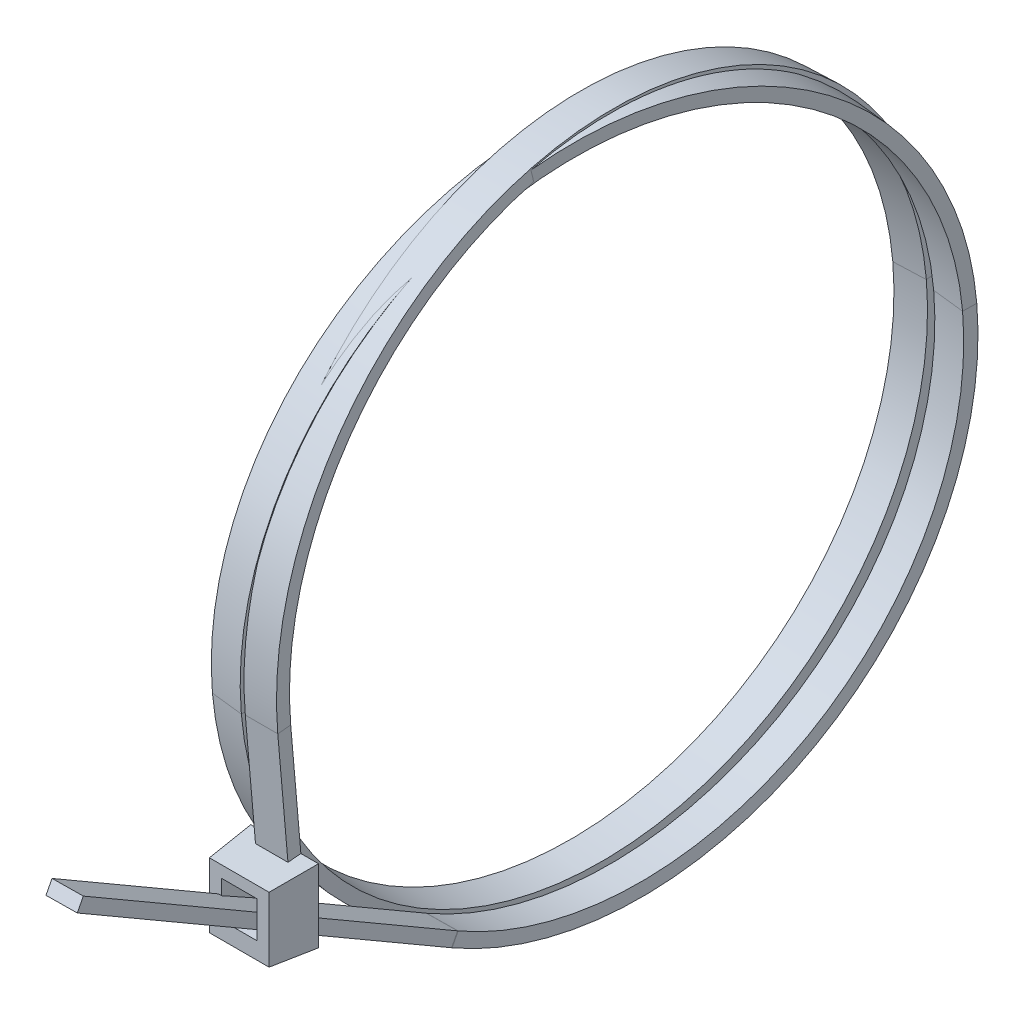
ISO-10303-21;
HEADER;
FILE_DESCRIPTION(('STEP AP214'),'2;1');
FILE_NAME('part.step','',(''),(''),'','','');
FILE_SCHEMA(('AUTOMOTIVE_DESIGN { 1 0 10303 214 1 1 1 1 }'));
ENDSEC;
DATA;
#1=APPLICATION_CONTEXT('core data for automotive mechanical design processes');
#2=APPLICATION_PROTOCOL_DEFINITION('international standard','automotive_design',2000,#1);
#3=PRODUCT_CONTEXT('',#1,'mechanical');
#4=PRODUCT('Part','Part','',(#3));
#5=PRODUCT_RELATED_PRODUCT_CATEGORY('part','',(#4));
#6=PRODUCT_DEFINITION_FORMATION('','',#4);
#7=PRODUCT_DEFINITION_CONTEXT('part definition',#1,'design');
#8=PRODUCT_DEFINITION('design','',#6,#7);
#9=PRODUCT_DEFINITION_SHAPE('','',#8);
#10=(LENGTH_UNIT() NAMED_UNIT(*) SI_UNIT(.MILLI.,.METRE.));
#11=(NAMED_UNIT(*) PLANE_ANGLE_UNIT() SI_UNIT($,.RADIAN.));
#12=(NAMED_UNIT(*) SI_UNIT($,.STERADIAN.) SOLID_ANGLE_UNIT());
#13=UNCERTAINTY_MEASURE_WITH_UNIT(LENGTH_MEASURE(1.E-05),#10,'distance_accuracy_value','');
#14=(GEOMETRIC_REPRESENTATION_CONTEXT(3) GLOBAL_UNCERTAINTY_ASSIGNED_CONTEXT((#13)) GLOBAL_UNIT_ASSIGNED_CONTEXT((#10,
#11,#12)) REPRESENTATION_CONTEXT('',''));
#15=CARTESIAN_POINT('',(0.,0.,0.));
#16=DIRECTION('',(0.,0.,1.));
#17=DIRECTION('',(1.,0.,0.));
#18=AXIS2_PLACEMENT_3D('',#15,#16,#17);
#19=CARTESIAN_POINT('',(-2.3,2.5,-3.5));
#20=DIRECTION('',(0.,0.,1.));
#21=DIRECTION('',(1.,0.,0.));
#22=AXIS2_PLACEMENT_3D('',#19,#20,#21);
#23=PLANE('',#22);
#24=DIRECTION('',(0.,-1.,0.));
#25=VECTOR('',#24,1.);
#26=CARTESIAN_POINT('',(-2.60621032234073,2.5,-3.5));
#27=LINE('',#26,#25);
#28=CARTESIAN_POINT('',(-2.60621032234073,2.80621032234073,-3.5));
#29=VERTEX_POINT('',#28);
#30=CARTESIAN_POINT('',(-2.60621032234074,-2.80621032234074,-3.5));
#31=VERTEX_POINT('',#30);
#32=EDGE_CURVE('E591',#29,#31,#27,.T.);
#33=ORIENTED_EDGE('',*,*,#32,.F.);
#34=DIRECTION('',(-1.,0.,0.));
#35=VECTOR('',#34,1.);
#36=CARTESIAN_POINT('',(-2.3,2.80621032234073,-3.5));
#37=LINE('',#36,#35);
#38=CARTESIAN_POINT('',(-1.25,2.80621032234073,-3.5));
#39=VERTEX_POINT('',#38);
#40=EDGE_CURVE('E599',#29,#39,#37,.F.);
#41=ORIENTED_EDGE('',*,*,#40,.T.);
#42=DIRECTION('',(-1.,0.,0.));
#43=VECTOR('',#42,1.);
#44=CARTESIAN_POINT('',(1.25,2.80621032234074,-3.5));
#45=LINE('',#44,#43);
#46=CARTESIAN_POINT('',(1.25,2.80621032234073,-3.5));
#47=VERTEX_POINT('',#46);
#48=EDGE_CURVE('E527',#47,#39,#45,.T.);
#49=ORIENTED_EDGE('',*,*,#48,.F.);
#50=CARTESIAN_POINT('',(2.60621032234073,2.80621032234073,-3.5));
#51=VERTEX_POINT('',#50);
#52=EDGE_CURVE('E607',#47,#51,#37,.F.);
#53=ORIENTED_EDGE('',*,*,#52,.T.);
#54=DIRECTION('',(0.,1.,0.));
#55=VECTOR('',#54,1.);
#56=CARTESIAN_POINT('',(2.60621032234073,2.5,-3.5));
#57=LINE('',#56,#55);
#58=CARTESIAN_POINT('',(2.60621032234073,-2.80621032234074,-3.5));
#59=VERTEX_POINT('',#58);
#60=EDGE_CURVE('E608',#59,#51,#57,.T.);
#61=ORIENTED_EDGE('',*,*,#60,.F.);
#62=DIRECTION('',(1.,0.,0.));
#63=VECTOR('',#62,1.);
#64=CARTESIAN_POINT('',(-2.3,-2.80621032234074,-3.5));
#65=LINE('',#64,#63);
#66=EDGE_CURVE('E604',#59,#31,#65,.F.);
#67=ORIENTED_EDGE('',*,*,#66,.T.);
#68=EDGE_LOOP('',(#33,#41,#49,#53,#61,#67));
#69=FACE_BOUND('',#68,.T.);
#70=DIRECTION('',(1.,0.,0.));
#71=VECTOR('',#70,1.);
#72=CARTESIAN_POINT('',(-1.35,1.6,-3.5));
#73=LINE('',#72,#71);
#74=CARTESIAN_POINT('',(-1.35,1.6,-3.5));
#75=VERTEX_POINT('',#74);
#76=CARTESIAN_POINT('',(1.35,1.6,-3.5));
#77=VERTEX_POINT('',#76);
#78=EDGE_CURVE('E556',#75,#77,#73,.T.);
#79=ORIENTED_EDGE('',*,*,#78,.F.);
#80=DIRECTION('',(0.,-1.,0.));
#81=VECTOR('',#80,1.);
#82=CARTESIAN_POINT('',(-1.35,1.6,-3.5));
#83=LINE('',#82,#81);
#84=CARTESIAN_POINT('',(-1.35,-1.2,-3.5));
#85=VERTEX_POINT('',#84);
#86=EDGE_CURVE('E547',#75,#85,#83,.T.);
#87=ORIENTED_EDGE('',*,*,#86,.T.);
#88=DIRECTION('',(-1.,0.,0.));
#89=VECTOR('',#88,1.);
#90=CARTESIAN_POINT('',(1.35,-1.2,-3.5));
#91=LINE('',#90,#89);
#92=CARTESIAN_POINT('',(1.35,-1.2,-3.5));
#93=VERTEX_POINT('',#92);
#94=EDGE_CURVE('E550',#93,#85,#91,.T.);
#95=ORIENTED_EDGE('',*,*,#94,.F.);
#96=DIRECTION('',(0.,1.,0.));
#97=VECTOR('',#96,1.);
#98=CARTESIAN_POINT('',(1.35,-1.2,-3.5));
#99=LINE('',#98,#97);
#100=EDGE_CURVE('E553',#93,#77,#99,.T.);
#101=ORIENTED_EDGE('',*,*,#100,.T.);
#102=EDGE_LOOP('',(#79,#87,#95,#101));
#103=FACE_BOUND('',#102,.T.);
#104=DIRECTION('',(0.999652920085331,0.0263446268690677,0.));
#105=VECTOR('',#104,1.);
#106=CARTESIAN_POINT('',(-2.19384495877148,-1.52807743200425,-3.5));
#107=LINE('',#106,#105);
#108=CARTESIAN_POINT('',(-1.39886744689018,-1.50712677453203,-3.5));
#109=VERTEX_POINT('',#108);
#110=CARTESIAN_POINT('',(1.10219782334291,-1.44121426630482,-3.5));
#111=VERTEX_POINT('',#110);
#112=EDGE_CURVE('E51',#109,#111,#107,.T.);
#113=ORIENTED_EDGE('',*,*,#112,.F.);
#114=DIRECTION('',(-0.0454682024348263,0.998965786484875,0.));
#115=VECTOR('',#114,1.);
#116=CARTESIAN_POINT('',(-1.58273883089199,2.53264633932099,-3.5));
#117=LINE('',#116,#115);
#118=CARTESIAN_POINT('',(-1.34681544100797,-2.65074297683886,-3.5));
#119=VERTEX_POINT('',#118);
#120=EDGE_CURVE('E55',#119,#109,#117,.T.);
#121=ORIENTED_EDGE('',*,*,#120,.F.);
#122=DIRECTION('',(-0.999652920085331,-0.0263446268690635,0.));
#123=VECTOR('',#122,1.);
#124=CARTESIAN_POINT('',(-2.16369114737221,-2.67227073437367,-3.5));
#125=LINE('',#124,#123);
#126=CARTESIAN_POINT('',(1.15424982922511,-2.58483046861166,-3.5));
#127=VERTEX_POINT('',#126);
#128=EDGE_CURVE('E304',#127,#119,#125,.T.);
#129=ORIENTED_EDGE('',*,*,#128,.F.);
#130=DIRECTION('',(0.0454682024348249,-0.998965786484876,0.));
#131=VECTOR('',#130,1.);
#132=CARTESIAN_POINT('',(0.916149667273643,2.64638393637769,-3.5));
#133=LINE('',#132,#131);
#134=EDGE_CURVE('E290',#111,#127,#133,.T.);
#135=ORIENTED_EDGE('',*,*,#134,.F.);
#136=EDGE_LOOP('',(#113,#121,#129,#135));
#137=FACE_BOUND('',#136,.T.);
#138=ADVANCED_FACE('F36',(#69,#103,#137),#23,.F.);
#139=CARTESIAN_POINT('',(-2.3,2.5,0.));
#140=DIRECTION('',(0.,0.,1.));
#141=DIRECTION('',(1.,0.,0.));
#142=AXIS2_PLACEMENT_3D('',#139,#140,#141);
#143=PLANE('',#142);
#144=DIRECTION('',(0.,-1.,0.));
#145=VECTOR('',#144,1.);
#146=CARTESIAN_POINT('',(-2.3,2.5,0.));
#147=LINE('',#146,#145);
#148=CARTESIAN_POINT('',(-2.3,2.5,0.));
#149=VERTEX_POINT('',#148);
#150=CARTESIAN_POINT('',(-2.3,-2.5,0.));
#151=VERTEX_POINT('',#150);
#152=EDGE_CURVE('E572',#149,#151,#147,.T.);
#153=ORIENTED_EDGE('',*,*,#152,.T.);
#154=DIRECTION('',(-1.,0.,0.));
#155=VECTOR('',#154,1.);
#156=CARTESIAN_POINT('',(2.3,-2.5,0.));
#157=LINE('',#156,#155);
#158=CARTESIAN_POINT('',(2.3,-2.5,0.));
#159=VERTEX_POINT('',#158);
#160=EDGE_CURVE('E582',#159,#151,#157,.T.);
#161=ORIENTED_EDGE('',*,*,#160,.F.);
#162=DIRECTION('',(0.,1.,0.));
#163=VECTOR('',#162,1.);
#164=CARTESIAN_POINT('',(2.3,-2.5,0.));
#165=LINE('',#164,#163);
#166=CARTESIAN_POINT('',(2.3,2.5,0.));
#167=VERTEX_POINT('',#166);
#168=EDGE_CURVE('E585',#159,#167,#165,.T.);
#169=ORIENTED_EDGE('',*,*,#168,.T.);
#170=DIRECTION('',(1.,0.,0.));
#171=VECTOR('',#170,1.);
#172=CARTESIAN_POINT('',(-2.3,2.5,0.));
#173=LINE('',#172,#171);
#174=EDGE_CURVE('E588',#149,#167,#173,.T.);
#175=ORIENTED_EDGE('',*,*,#174,.F.);
#176=EDGE_LOOP('',(#153,#161,#169,#175));
#177=FACE_BOUND('',#176,.T.);
#178=DIRECTION('',(-0.0454682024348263,0.998965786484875,0.));
#179=VECTOR('',#178,1.);
#180=CARTESIAN_POINT('',(-1.70288387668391,2.52717790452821,0.));
#181=LINE('',#180,#179);
#182=CARTESIAN_POINT('',(-1.55569856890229,-0.706578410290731,0.));
#183=VERTEX_POINT('',#182);
#184=CARTESIAN_POINT('',(-1.60775057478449,0.4370377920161,0.));
#185=VERTEX_POINT('',#184);
#186=EDGE_CURVE('E11',#183,#185,#181,.T.);
#187=ORIENTED_EDGE('',*,*,#186,.T.);
#188=DIRECTION('',(0.999652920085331,0.0263446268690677,0.));
#189=VECTOR('',#188,1.);
#190=CARTESIAN_POINT('',(-2.24519044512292,0.420238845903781,0.));
#191=LINE('',#190,#189);
#192=CARTESIAN_POINT('',(-1.35,0.443830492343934,0.));
#193=VERTEX_POINT('',#192);
#194=EDGE_CURVE('E289',#185,#193,#191,.T.);
#195=ORIENTED_EDGE('',*,*,#194,.T.);
#196=DIRECTION('',(0.,-1.,0.));
#197=VECTOR('',#196,1.);
#198=CARTESIAN_POINT('',(-1.35,1.6,0.));
#199=LINE('',#198,#197);
#200=CARTESIAN_POINT('',(-1.35,1.6,0.));
#201=VERTEX_POINT('',#200);
#202=EDGE_CURVE('E559',#201,#193,#199,.T.);
#203=ORIENTED_EDGE('',*,*,#202,.F.);
#204=DIRECTION('',(1.,0.,0.));
#205=VECTOR('',#204,1.);
#206=CARTESIAN_POINT('',(-1.35,1.6,0.));
#207=LINE('',#206,#205);
#208=CARTESIAN_POINT('',(1.35,1.6,0.));
#209=VERTEX_POINT('',#208);
#210=EDGE_CURVE('E551',#201,#209,#207,.T.);
#211=ORIENTED_EDGE('',*,*,#210,.T.);
#212=DIRECTION('',(0.,1.,0.));
#213=VECTOR('',#212,1.);
#214=CARTESIAN_POINT('',(1.35,-1.2,0.));
#215=LINE('',#214,#213);
#216=CARTESIAN_POINT('',(1.35,-1.2,0.));
#217=VERTEX_POINT('',#216);
#218=EDGE_CURVE('E565',#217,#209,#215,.T.);
#219=ORIENTED_EDGE('',*,*,#218,.F.);
#220=DIRECTION('',(-1.,0.,0.));
#221=VECTOR('',#220,1.);
#222=CARTESIAN_POINT('',(1.35,-1.2,0.));
#223=LINE('',#222,#221);
#224=CARTESIAN_POINT('',(-1.35,-1.2,0.));
#225=VERTEX_POINT('',#224);
#226=EDGE_CURVE('E562',#217,#225,#223,.T.);
#227=ORIENTED_EDGE('',*,*,#226,.T.);
#228=CARTESIAN_POINT('',(-1.35,-0.701157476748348,0.));
#229=VERTEX_POINT('',#228);
#230=EDGE_CURVE('E546',#229,#225,#199,.T.);
#231=ORIENTED_EDGE('',*,*,#230,.F.);
#232=DIRECTION('',(-0.999652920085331,-0.0263446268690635,0.));
#233=VECTOR('',#232,1.);
#234=CARTESIAN_POINT('',(-2.21503663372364,-0.723954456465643,0.));
#235=LINE('',#234,#233);
#236=EDGE_CURVE('E301',#229,#183,#235,.T.);
#237=ORIENTED_EDGE('',*,*,#236,.T.);
#238=EDGE_LOOP('',(#187,#195,#203,#211,#219,#227,#231,#237));
#239=FACE_BOUND('',#238,.T.);
#240=ADVANCED_FACE('F628',(#177,#239),#143,.T.);
#241=CARTESIAN_POINT('',(-1.35,1.6,-3.5));
#242=DIRECTION('',(-1.,0.,0.));
#243=DIRECTION('',(0.,-1.,0.));
#244=AXIS2_PLACEMENT_3D('',#241,#242,#243);
#245=PLANE('',#244);
#246=DIRECTION('',(0.,0.486639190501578,0.87360305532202));
#247=VECTOR('',#246,1.);
#248=CARTESIAN_POINT('',(-1.35,-0.770321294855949,-2.17961629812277));
#249=LINE('',#248,#247);
#250=CARTESIAN_POINT('',(-1.35,-1.2,-2.95096525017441));
#251=VERTEX_POINT('',#250);
#252=EDGE_CURVE('E306',#251,#193,#249,.T.);
#253=ORIENTED_EDGE('',*,*,#252,.F.);
#254=DIRECTION('',(0.,0.,1.));
#255=VECTOR('',#254,1.);
#256=CARTESIAN_POINT('',(-1.35,-1.2,-3.5));
#257=LINE('',#256,#255);
#258=EDGE_CURVE('E577',#85,#251,#257,.T.);
#259=ORIENTED_EDGE('',*,*,#258,.F.);
#260=ORIENTED_EDGE('',*,*,#86,.F.);
#261=DIRECTION('',(0.,0.,1.));
#262=VECTOR('',#261,1.);
#263=CARTESIAN_POINT('',(-1.35,1.6,-3.5));
#264=LINE('',#263,#262);
#265=EDGE_CURVE('E570',#75,#201,#264,.T.);
#266=ORIENTED_EDGE('',*,*,#265,.T.);
#267=ORIENTED_EDGE('',*,*,#202,.T.);
#268=EDGE_LOOP('',(#253,#259,#260,#266,#267));
#269=FACE_BOUND('',#268,.T.);
#270=ADVANCED_FACE('F623',(#269),#245,.F.);
#271=DIRECTION('',(0.,-0.486639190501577,-0.873603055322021));
#272=VECTOR('',#271,1.);
#273=CARTESIAN_POINT('',(-1.35,-1.64415584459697,-1.69284815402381));
#274=LINE('',#273,#272);
#275=CARTESIAN_POINT('',(-1.35,-1.2,-0.895510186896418));
#276=VERTEX_POINT('',#275);
#277=EDGE_CURVE('E294',#229,#276,#274,.T.);
#278=ORIENTED_EDGE('',*,*,#277,.F.);
#279=ORIENTED_EDGE('',*,*,#230,.T.);
#280=EDGE_CURVE('E558',#276,#225,#257,.T.);
#281=ORIENTED_EDGE('',*,*,#280,.F.);
#282=EDGE_LOOP('',(#278,#279,#281));
#283=FACE_BOUND('',#282,.T.);
#284=ADVANCED_FACE('F746',(#283),#245,.F.);
#285=CARTESIAN_POINT('',(1.35,-1.2,-3.5));
#286=DIRECTION('',(0.,1.,0.));
#287=DIRECTION('',(-1.,0.,0.));
#288=AXIS2_PLACEMENT_3D('',#285,#286,#287);
#289=PLANE('',#288);
#290=ORIENTED_EDGE('',*,*,#258,.T.);
#291=DIRECTION('',(0.99888277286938,0.,-0.0472568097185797));
#292=VECTOR('',#291,1.);
#293=CARTESIAN_POINT('',(1.36988698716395,-1.2,-3.07964219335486));
#294=LINE('',#293,#292);
#295=CARTESIAN_POINT('',(1.07628150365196,-1.2,-3.06575181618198));
#296=VERTEX_POINT('',#295);
#297=EDGE_CURVE('E44',#251,#296,#294,.T.);
#298=ORIENTED_EDGE('',*,*,#297,.T.);
#299=DIRECTION('',(-0.0343779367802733,0.,0.999408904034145));
#300=VECTOR('',#299,1.);
#301=CARTESIAN_POINT('',(1.09152472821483,-1.2,-3.50889110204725));
#302=LINE('',#301,#300);
#303=CARTESIAN_POINT('',(1.00546215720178,-1.2,-1.00694631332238));
#304=VERTEX_POINT('',#303);
#305=EDGE_CURVE('E594',#296,#304,#302,.T.);
#306=ORIENTED_EDGE('',*,*,#305,.T.);
#307=DIRECTION('',(-0.998882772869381,0.,0.0472568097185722));
#308=VECTOR('',#307,1.);
#309=CARTESIAN_POINT('',(1.46691271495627,-1.2,-1.02877738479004));
#310=LINE('',#309,#308);
#311=EDGE_CURVE('E614',#304,#276,#310,.T.);
#312=ORIENTED_EDGE('',*,*,#311,.T.);
#313=ORIENTED_EDGE('',*,*,#280,.T.);
#314=ORIENTED_EDGE('',*,*,#226,.F.);
#315=DIRECTION('',(0.,0.,1.));
#316=VECTOR('',#315,1.);
#317=CARTESIAN_POINT('',(1.35,-1.2,-3.5));
#318=LINE('',#317,#316);
#319=EDGE_CURVE('E575',#93,#217,#318,.T.);
#320=ORIENTED_EDGE('',*,*,#319,.F.);
#321=ORIENTED_EDGE('',*,*,#94,.T.);
#322=EDGE_LOOP('',(#290,#298,#306,#312,#313,#314,#320,#321));
#323=FACE_BOUND('',#322,.T.);
#324=ADVANCED_FACE('F618',(#323),#289,.T.);
#325=CARTESIAN_POINT('',(-1.68586297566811,13.9482914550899,-27.5911508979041));
#326=DIRECTION('',(-0.999847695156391,-0.00152107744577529,0.0173859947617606));
#327=DIRECTION('',(0.0173860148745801,0.,0.999848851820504));
#328=AXIS2_PLACEMENT_3D('',#325,#326,#327);
#329=CONICAL_SURFACE('',#328,24.9743768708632,1.55334303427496);
#330=CARTESIAN_POINT('',(-1.2500122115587,11.6846068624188,-3.81490356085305));
#331=CARTESIAN_POINT('',(-1.24991787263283,12.3579629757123,-3.75689353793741));
#332=CARTESIAN_POINT('',(-1.25033255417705,13.0308929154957,-3.6940592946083));
#333=CARTESIAN_POINT('',(-1.25214862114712,14.3757952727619,-3.55905085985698));
#334=CARTESIAN_POINT('',(-1.25354997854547,15.0477677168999,-3.48687693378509));
#335=CARTESIAN_POINT('',(-1.25918511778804,17.0614406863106,-3.25688380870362));
#336=CARTESIAN_POINT('',(-1.2648499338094,18.4016067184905,-3.08553147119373));
#337=CARTESIAN_POINT('',(-1.27942836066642,21.0773474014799,-2.71220020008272));
#338=CARTESIAN_POINT('',(-1.28834145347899,22.4129227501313,-2.51022615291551));
#339=CARTESIAN_POINT('',(-1.30874603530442,25.0808750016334,-2.08193237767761));
#340=CARTESIAN_POINT('',(-1.32023885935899,26.4132498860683,-1.85560007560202));
#341=CARTESIAN_POINT('',(-1.33268113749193,27.7439212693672,-1.62034885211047));
#342=B_SPLINE_CURVE_WITH_KNOTS('',3,(#330,#331,#332,#333,#334,#335,#336,#337,#338,#339,#340,
#341),.UNSPECIFIED.,.F.,.F.,(4,2,2,2,2,4),(0.,2.02751463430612,4.05497167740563,
8.10774884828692,12.1598799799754,16.2141129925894),.UNSPECIFIED.);
#343=CARTESIAN_POINT('',(-1.26751178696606,18.8452721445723,-3.02129319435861));
#344=VERTEX_POINT('',#343);
#345=CARTESIAN_POINT('',(-1.28124984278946,21.2816691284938,-2.67692792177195));
#346=VERTEX_POINT('',#345);
#347=EDGE_CURVE('E454',#344,#346,#342,.T.);
#348=ORIENTED_EDGE('',*,*,#347,.F.);
#349=CARTESIAN_POINT('',(-1.71223216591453,38.8046329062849,-27.045440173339));
#350=CARTESIAN_POINT('',(-1.70605222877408,38.7968317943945,-26.6907428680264));
#351=CARTESIAN_POINT('',(-1.69986642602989,38.7815478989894,-26.3362497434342));
#352=CARTESIAN_POINT('',(-1.68749287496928,38.7360488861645,-25.6282315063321));
#353=CARTESIAN_POINT('',(-1.68130512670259,38.7058341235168,-25.2747063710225));
#354=CARTESIAN_POINT('',(-1.66275626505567,38.5928626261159,-24.2165719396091));
#355=CARTESIAN_POINT('',(-1.6504064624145,38.4877747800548,-23.5142272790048));
#356=CARTESIAN_POINT('',(-1.62583685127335,38.2188328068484,-22.1212739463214));
#357=CARTESIAN_POINT('',(-1.61361697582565,38.055010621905,-21.4306591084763));
#358=CARTESIAN_POINT('',(-1.59544778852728,37.7661353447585,-20.4071266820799));
#359=CARTESIAN_POINT('',(-1.58941792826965,37.6626483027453,-20.0680010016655));
#360=CARTESIAN_POINT('',(-1.57741961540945,37.4414348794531,-19.394327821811));
#361=CARTESIAN_POINT('',(-1.57145117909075,37.3237048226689,-19.0597815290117));
#362=CARTESIAN_POINT('',(-1.5536549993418,36.9494471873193,-18.0639773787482));
#363=CARTESIAN_POINT('',(-1.54193564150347,36.6718403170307,-17.4105123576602));
#364=CARTESIAN_POINT('',(-1.51887437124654,36.0624016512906,-16.1293704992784));
#365=CARTESIAN_POINT('',(-1.50753245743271,35.7305700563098,-15.501693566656));
#366=CARTESIAN_POINT('',(-1.49086577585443,35.1940124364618,-14.5830743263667));
#367=CARTESIAN_POINT('',(-1.48536765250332,35.0086814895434,-14.2806696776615));
#368=CARTESIAN_POINT('',(-1.47449683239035,34.6254311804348,-13.6840552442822));
#369=CARTESIAN_POINT('',(-1.46912410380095,34.4275150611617,-13.3898433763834));
#370=CARTESIAN_POINT('',(-1.45320546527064,33.8152838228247,-12.5201447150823));
#371=CARTESIAN_POINT('',(-1.4428579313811,33.3824481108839,-11.9575303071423));
#372=CARTESIAN_POINT('',(-1.42280951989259,32.4723417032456,-10.8731282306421));
#373=CARTESIAN_POINT('',(-1.41310638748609,31.9952416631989,-10.3511969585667));
#374=CARTESIAN_POINT('',(-1.39437226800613,30.9985553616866,-9.3495886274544));
#375=CARTESIAN_POINT('',(-1.38534128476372,30.478968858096,-8.86991180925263));
#376=CARTESIAN_POINT('',(-1.36801234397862,29.4007191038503,-7.9561683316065));
#377=CARTESIAN_POINT('',(-1.35971462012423,28.8420434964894,-7.52211620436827));
#378=CARTESIAN_POINT('',(-1.34786799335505,27.9780675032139,-6.90795978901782));
#379=CARTESIAN_POINT('',(-1.34401899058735,27.6857380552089,-6.70938850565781));
#380=CARTESIAN_POINT('',(-1.33652582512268,27.0928108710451,-6.32481616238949));
#381=CARTESIAN_POINT('',(-1.33288171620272,26.7922109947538,-6.13881839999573));
#382=CARTESIAN_POINT('',(-1.32231527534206,25.8829463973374,-5.60268491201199));
#383=CARTESIAN_POINT('',(-1.31570509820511,25.2628952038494,-5.27162330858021));
#384=CARTESIAN_POINT('',(-1.30337202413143,23.9969470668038,-4.66326870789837));
#385=CARTESIAN_POINT('',(-1.29764911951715,23.3510503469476,-4.38597524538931));
#386=CARTESIAN_POINT('',(-1.28976377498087,22.3667092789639,-4.01204843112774));
#387=CARTESIAN_POINT('',(-1.2872524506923,22.0361102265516,-3.89443617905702));
#388=CARTESIAN_POINT('',(-1.28246636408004,21.3702998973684,-3.67338582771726));
#389=CARTESIAN_POINT('',(-1.28019154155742,21.0350898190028,-3.56994411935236));
#390=CARTESIAN_POINT('',(-1.27372857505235,20.0235127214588,-3.28119879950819));
#391=CARTESIAN_POINT('',(-1.26989943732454,19.340887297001,-3.11735667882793));
#392=CARTESIAN_POINT('',(-1.26338035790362,17.9953788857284,-2.85440145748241));
#393=CARTESIAN_POINT('',(-1.26064668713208,17.3330013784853,-2.752693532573));
#394=CARTESIAN_POINT('',(-1.25723699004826,16.3355921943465,-2.64079537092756));
#395=CARTESIAN_POINT('',(-1.25621608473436,16.0027420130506,-2.61028122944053));
#396=CARTESIAN_POINT('',(-1.25440451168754,15.3360655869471,-2.56278290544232));
#397=CARTESIAN_POINT('',(-1.25361385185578,15.0022393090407,-2.54579918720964));
#398=CARTESIAN_POINT('',(-1.25293898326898,14.6681725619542,-2.53560002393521));
#399=B_SPLINE_CURVE_WITH_KNOTS('',3,(#349,#350,#351,#352,#353,#354,#355,#356,#357,#358,#359,
#360,#361,#362,#363,#364,#365,#366,#367,#368,#369,#370,#371,#372,#373,#374,#375,#376,#377,#378,
#379,#380,#381,#382,#383,#384,#385,#386,#387,#388,#389,#390,#391,#392,#393,#394,#395,#396,#397,
#398),.UNSPECIFIED.,.F.,.F.,(4,2,2,2,2,2,2,2,2,2,2,2,2,2,2,2,2,2,2,2,2,2,2,2,4),(0.,
1.06435297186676,2.12868065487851,4.25680851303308,6.38378075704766,7.44735107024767,
8.51119643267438,10.6387569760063,12.7663096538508,13.8301902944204,14.8937978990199,
17.0207895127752,19.139896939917,21.259016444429,23.3788088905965,24.4387770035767,
25.4990220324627,27.6051282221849,29.7112161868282,30.7636550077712,31.81582528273,
33.9191693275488,35.9272817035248,36.9297816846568,37.9323160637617),.UNSPECIFIED.);
#400=CARTESIAN_POINT('',(-1.37383807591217,29.7616818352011,-8.26348095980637));
#401=VERTEX_POINT('',#400);
#402=EDGE_CURVE('E1014',#401,#344,#399,.T.);
#403=ORIENTED_EDGE('',*,*,#402,.F.);
#404=CARTESIAN_POINT('',(-1.68586297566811,13.9482914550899,-27.5911508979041));
#405=DIRECTION('',(0.999847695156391,0.00152107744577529,-0.0173859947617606));
#406=DIRECTION('',(-0.0173860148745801,0.,-0.999848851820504));
#407=AXIS2_PLACEMENT_3D('',#404,#405,#406);
#408=CIRCLE('',#407,24.9743768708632);
#409=CARTESIAN_POINT('',(-1.25,11.7719626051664,-2.71559831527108));
#410=VERTEX_POINT('',#409);
#411=EDGE_CURVE('E506',#401,#410,#408,.T.);
#412=ORIENTED_EDGE('',*,*,#411,.T.);
#413=DIRECTION('',(0.,-0.0871557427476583,0.996194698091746));
#414=VECTOR('',#413,1.);
#415=CARTESIAN_POINT('',(-1.25,11.7719626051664,-2.71559831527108));
#416=LINE('',#415,#414);
#417=CARTESIAN_POINT('',(-1.25,11.6848068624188,-1.71940361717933));
#418=VERTEX_POINT('',#417);
#419=EDGE_CURVE('E518',#410,#418,#416,.T.);
#420=ORIENTED_EDGE('',*,*,#419,.T.);
#421=CARTESIAN_POINT('',(-1.70331272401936,13.9482649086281,-27.5908474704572));
#422=DIRECTION('',(0.999847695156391,0.00152107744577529,-0.0173859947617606));
#423=DIRECTION('',(-0.0173860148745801,0.,-0.999848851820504));
#424=AXIS2_PLACEMENT_3D('',#421,#422,#423);
#425=CIRCLE('',#424,25.9742245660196);
#426=EDGE_CURVE('E496',#346,#418,#425,.T.);
#427=ORIENTED_EDGE('',*,*,#426,.F.);
#428=EDGE_LOOP('',(#348,#403,#412,#420,#427));
#429=FACE_BOUND('',#428,.T.);
#430=ADVANCED_FACE('F745',(#429),#329,.F.);
#431=CARTESIAN_POINT('',(-1.64788015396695,39.8045914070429,-21.5630926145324));
#432=CARTESIAN_POINT('',(-1.63126839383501,38.7242460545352,-21.8162646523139));
#433=CARTESIAN_POINT('',(-1.61465663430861,37.6439007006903,-22.0694366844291));
#434=CARTESIAN_POINT('',(-1.5813988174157,35.4809792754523,-22.5763034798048));
#435=CARTESIAN_POINT('',(-1.56475276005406,34.3984032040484,-22.8299982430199));
#436=CARTESIAN_POINT('',(-1.53954354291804,32.7589219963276,-23.2142001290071));
#437=CARTESIAN_POINT('',(-1.53098038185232,32.2020168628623,-23.344707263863));
#438=CARTESIAN_POINT('',(-1.51385379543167,31.0881893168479,-23.6057255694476));
#439=CARTESIAN_POINT('',(-1.50529037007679,30.5312669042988,-23.736236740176));
#440=CARTESIAN_POINT('',(-1.48818114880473,29.4185685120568,-23.9969904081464));
#441=CARTESIAN_POINT('',(-1.47963535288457,28.8627925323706,-24.1272329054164));
#442=CARTESIAN_POINT('',(-1.46254473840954,27.7513039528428,-24.3877030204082));
#443=CARTESIAN_POINT('',(-1.45399991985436,27.1955913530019,-24.5179306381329));
#444=CARTESIAN_POINT('',(-1.43724292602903,26.1057994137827,-24.7733162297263));
#445=CARTESIAN_POINT('',(-1.42903075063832,25.5717200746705,-24.898474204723));
#446=CARTESIAN_POINT('',(-1.41260296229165,24.5033375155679,-25.1488425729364));
#447=CARTESIAN_POINT('',(-1.40438734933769,23.969034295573,-25.2740529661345));
#448=CARTESIAN_POINT('',(-1.38789975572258,22.8967614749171,-25.5253328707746));
#449=CARTESIAN_POINT('',(-1.37962777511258,22.3587918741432,-25.6514023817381));
#450=CARTESIAN_POINT('',(-1.36722605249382,21.5522431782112,-25.8404114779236));
#451=CARTESIAN_POINT('',(-1.36309630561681,21.2836640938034,-25.9033511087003));
#452=CARTESIAN_POINT('',(-1.35483723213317,20.7465329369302,-26.0292239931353));
#453=CARTESIAN_POINT('',(-1.35070790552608,20.4779808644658,-26.092157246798));
#454=CARTESIAN_POINT('',(-1.34253819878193,19.9466609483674,-26.21666819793));
#455=CARTESIAN_POINT('',(-1.33849781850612,19.6838931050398,-26.2782458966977));
#456=CARTESIAN_POINT('',(-1.33041556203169,19.1582594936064,-26.4014241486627));
#457=CARTESIAN_POINT('',(-1.32637368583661,18.8953937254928,-26.4630247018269));
#458=CARTESIAN_POINT('',(-1.31826444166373,18.3680033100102,-26.5866144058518));
#459=CARTESIAN_POINT('',(-1.31419707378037,18.1034786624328,-26.6486035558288));
#460=CARTESIAN_POINT('',(-1.30606801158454,17.5747965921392,-26.772495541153));
#461=CARTESIAN_POINT('',(-1.3020063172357,17.3106391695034,-26.8343983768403));
#462=CARTESIAN_POINT('',(-1.29594791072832,16.9166205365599,-26.9267326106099));
#463=CARTESIAN_POINT('',(-1.29395117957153,16.7867593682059,-26.9571641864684));
#464=CARTESIAN_POINT('',(-1.28995713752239,16.5269979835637,-27.0180362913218));
#465=CARTESIAN_POINT('',(-1.28795982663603,16.3970977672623,-27.0484768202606));
#466=CARTESIAN_POINT('',(-1.28395407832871,16.1365716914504,-27.1095276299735));
#467=CARTESIAN_POINT('',(-1.28194564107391,16.0059458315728,-27.1401379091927));
#468=CARTESIAN_POINT('',(-1.27793106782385,15.7448402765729,-27.2013237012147));
#469=CARTESIAN_POINT('',(-1.2759249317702,15.6143605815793,-27.2318992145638));
#470=CARTESIAN_POINT('',(-1.27293175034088,15.4196779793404,-27.2775187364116));
#471=CARTESIAN_POINT('',(-1.27194466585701,15.3554751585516,-27.2925631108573));
#472=CARTESIAN_POINT('',(-1.26997032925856,15.2270559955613,-27.3226546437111));
#473=CARTESIAN_POINT('',(-1.26898307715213,15.1628396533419,-27.3377018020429));
#474=CARTESIAN_POINT('',(-1.2670042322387,15.0341206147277,-27.3678626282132));
#475=CARTESIAN_POINT('',(-1.26601263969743,14.96961791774,-27.3829762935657));
#476=CARTESIAN_POINT('',(-1.26403033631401,14.8406626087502,-27.4131908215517));
#477=CARTESIAN_POINT('',(-1.26303962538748,14.7762099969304,-27.428291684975));
#478=CARTESIAN_POINT('',(-1.26107265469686,14.6482322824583,-27.4582742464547));
#479=CARTESIAN_POINT('',(-1.26009639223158,14.5847071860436,-27.4731559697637));
#480=CARTESIAN_POINT('',(-1.25863083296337,14.4893184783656,-27.4954985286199));
#481=CARTESIAN_POINT('',(-1.25814134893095,14.4574552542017,-27.5029611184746));
#482=CARTESIAN_POINT('',(-1.25716279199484,14.3937445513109,-27.5178809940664));
#483=CARTESIAN_POINT('',(-1.25667371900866,14.3618970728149,-27.5253382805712));
#484=CARTESIAN_POINT('',(-1.2557020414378,14.2985852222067,-27.5401575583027));
#485=CARTESIAN_POINT('',(-1.2552194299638,14.2671208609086,-27.5475196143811));
#486=CARTESIAN_POINT('',(-1.2542535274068,14.2041308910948,-27.5622555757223));
#487=CARTESIAN_POINT('',(-1.25377023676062,14.1726052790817,-27.569629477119));
#488=CARTESIAN_POINT('',(-1.25305123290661,14.1254521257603,-27.580621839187));
#489=CARTESIAN_POINT('',(-1.25281360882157,14.1098268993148,-27.5842583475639));
#490=CARTESIAN_POINT('',(-1.25233672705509,14.0785473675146,-27.5915495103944));
#491=CARTESIAN_POINT('',(-1.25209746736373,14.0628930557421,-27.5952041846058));
#492=CARTESIAN_POINT('',(-1.25163604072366,14.0316478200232,-27.6023447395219));
#493=CARTESIAN_POINT('',(-1.25141379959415,14.0160569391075,-27.6058313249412));
#494=CARTESIAN_POINT('',(-1.25095152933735,13.9848998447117,-27.6129722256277));
#495=CARTESIAN_POINT('',(-1.25071159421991,13.9693338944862,-27.6166256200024));
#496=CARTESIAN_POINT('',(-1.25068748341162,13.9476817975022,-27.6187502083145));
#497=CARTESIAN_POINT('',(-1.25071104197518,13.9418259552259,-27.6190375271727));
#498=CARTESIAN_POINT('',(-1.25080239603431,13.9301200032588,-27.6191891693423));
#499=CARTESIAN_POINT('',(-1.2508701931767,13.9242698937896,-27.6190534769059));
#500=CARTESIAN_POINT('',(-1.25108721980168,13.9067256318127,-27.6185156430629));
#501=CARTESIAN_POINT('',(-1.2512500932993,13.8950365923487,-27.6179827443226));
#502=CARTESIAN_POINT('',(-1.25174843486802,13.8599603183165,-27.6162920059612));
#503=CARTESIAN_POINT('',(-1.25209343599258,13.8365782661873,-27.6150426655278));
#504=CARTESIAN_POINT('',(-1.25313301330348,13.7663895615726,-27.6112546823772));
#505=CARTESIAN_POINT('',(-1.25383151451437,13.7195848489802,-27.608678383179));
#506=CARTESIAN_POINT('',(-1.25593108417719,13.5790763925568,-27.6009189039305));
#507=CARTESIAN_POINT('',(-1.25733479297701,13.4853742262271,-27.5957103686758));
#508=CARTESIAN_POINT('',(-1.26014503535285,13.2978136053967,-27.5852799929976));
#509=CARTESIAN_POINT('',(-1.2615515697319,13.2039551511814,-27.5800581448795));
#510=CARTESIAN_POINT('',(-1.26436428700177,13.0162912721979,-27.5696131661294));
#511=CARTESIAN_POINT('',(-1.26577046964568,12.9224858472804,-27.5643900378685));
#512=CARTESIAN_POINT('',(-1.26999900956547,12.6404135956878,-27.5486826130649));
#513=CARTESIAN_POINT('',(-1.27282152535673,12.4521468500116,-27.5381967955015));
#514=CARTESIAN_POINT('',(-1.2784598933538,12.0760708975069,-27.5172487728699));
#515=CARTESIAN_POINT('',(-1.28127574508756,11.8882616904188,-27.5067865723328));
#516=CARTESIAN_POINT('',(-1.28409158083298,11.7004524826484,-27.4963245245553));
#517=B_SPLINE_CURVE_WITH_KNOTS('',3,(#431,#432,#433,#434,#435,#436,#437,#438,#439,#440,#441,
#442,#443,#444,#445,#446,#447,#448,#449,#450,#451,#452,#453,#454,#455,#456,#457,#458,#459,#460,
#461,#462,#463,#464,#465,#466,#467,#468,#469,#470,#471,#472,#473,#474,#475,#476,#477,#478,#479,
#480,#481,#482,#483,#484,#485,#486,#487,#488,#489,#490,#491,#492,#493,#494,#495,#496,#497,#498,
#499,#500,#501,#502,#503,#504,#505,#506,#507,#508,#509,#510,#511,#512,#513,#514,#515,#516),
.UNSPECIFIED.,.F.,.F.,(4,2,2,2,2,2,2,2,2,2,2,2,2,2,2,2,2,2,2,2,2,2,2,2,2,2,2,2,2,2,2,2,2,2,2,2,
2,2,2,2,2,2,4),(0.,3.32921357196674,6.66530135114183,8.38147118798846,10.097694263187,
11.8103844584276,13.5228793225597,15.1687086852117,16.8152279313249,18.4730455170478,
19.3007040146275,20.1282792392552,20.9380296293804,21.7480817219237,22.5632457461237,
23.3772779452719,23.7774603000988,24.1777628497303,24.5803013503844,24.9823890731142,
25.1802369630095,25.3781262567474,25.5768975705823,25.7755138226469,25.9712705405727,
26.0694579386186,26.1675954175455,26.2645495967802,26.361686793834,26.4098244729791,
26.4580394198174,26.5060305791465,26.5537829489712,26.5713365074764,26.5888907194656,
26.6239962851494,26.6942504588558,26.8348924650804,27.11646462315,27.3985069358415,
27.6803906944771,28.2461296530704,28.8104940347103),.UNSPECIFIED.);
#518=CARTESIAN_POINT('',(-1.63770078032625,39.1425761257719,-21.718231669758));
#519=VERTEX_POINT('',#518);
#520=CARTESIAN_POINT('',(-1.62429544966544,38.2707607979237,-21.9225360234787));
#521=VERTEX_POINT('',#520);
#522=EDGE_CURVE('E1007',#519,#521,#517,.T.);
#523=ORIENTED_EDGE('',*,*,#522,.F.);
#524=CARTESIAN_POINT('',(-1.25684027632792,16.1970372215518,-1.62034885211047));
#525=CARTESIAN_POINT('',(-1.25793087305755,16.5574395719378,-1.65251568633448));
#526=CARTESIAN_POINT('',(-1.25915077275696,16.9171214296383,-1.69229459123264));
#527=CARTESIAN_POINT('',(-1.26184707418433,17.6344753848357,-1.78699727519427));
#528=CARTESIAN_POINT('',(-1.2633234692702,17.9921475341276,-1.8419206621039));
#529=CARTESIAN_POINT('',(-1.26813342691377,19.0611220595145,-2.02925630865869));
#530=CARTESIAN_POINT('',(-1.27184838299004,19.7685876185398,-2.18425239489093));
#531=CARTESIAN_POINT('',(-1.28026446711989,21.1672668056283,-2.55312795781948));
#532=CARTESIAN_POINT('',(-1.28496465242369,21.8584952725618,-2.76695120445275));
#533=CARTESIAN_POINT('',(-1.29272918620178,22.879831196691,-3.13059882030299));
#534=CARTESIAN_POINT('',(-1.29543654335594,23.21770675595,-3.25897349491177));
#535=CARTESIAN_POINT('',(-1.30108561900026,23.8878495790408,-3.52983705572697));
#536=CARTESIAN_POINT('',(-1.30402739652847,24.2201154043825,-3.67232949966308));
#537=CARTESIAN_POINT('',(-1.31320072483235,25.2080046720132,-4.12079711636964));
#538=CARTESIAN_POINT('',(-1.31977704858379,25.8542960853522,-4.44761160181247));
#539=CARTESIAN_POINT('',(-1.33380053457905,27.1171768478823,-5.15430129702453));
#540=CARTESIAN_POINT('',(-1.34124770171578,27.7337660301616,-5.5341768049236));
#541=CARTESIAN_POINT('',(-1.35303019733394,28.6330365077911,-6.14158521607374));
#542=CARTESIAN_POINT('',(-1.35706003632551,28.9285494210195,-6.35034064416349));
#543=CARTESIAN_POINT('',(-1.36531606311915,29.5105046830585,-6.77997533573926));
#544=CARTESIAN_POINT('',(-1.3695422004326,29.7969493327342,-7.00085148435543));
#545=CARTESIAN_POINT('',(-1.38250662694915,30.6420930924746,-7.68120034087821));
#546=CARTESIAN_POINT('',(-1.39153165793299,31.1866575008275,-8.1584309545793));
#547=CARTESIAN_POINT('',(-1.41033519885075,32.2371454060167,-9.15956448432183));
#548=CARTESIAN_POINT('',(-1.42011788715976,32.7428186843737,-9.68372913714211));
#549=CARTESIAN_POINT('',(-1.44032191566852,33.708500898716,-10.7725526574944));
#550=CARTESIAN_POINT('',(-1.4507432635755,34.1685092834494,-11.3372120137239));
#551=CARTESIAN_POINT('',(-1.47215880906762,35.0399507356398,-12.5033514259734));
#552=CARTESIAN_POINT('',(-1.48315327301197,35.4513609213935,-13.1048486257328));
#553=CARTESIAN_POINT('',(-1.50000942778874,36.0296138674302,-14.0310685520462));
#554=CARTESIAN_POINT('',(-1.50568908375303,36.2158933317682,-14.3438149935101));
#555=CARTESIAN_POINT('',(-1.51716269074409,36.5752827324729,-14.9768903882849));
#556=CARTESIAN_POINT('',(-1.52295667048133,36.7483893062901,-15.2972212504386));
#557=CARTESIAN_POINT('',(-1.54058176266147,37.249941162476,-16.2735476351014));
#558=CARTESIAN_POINT('',(-1.55257238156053,37.5577480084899,-16.9402804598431));
#559=CARTESIAN_POINT('',(-1.57688810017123,38.1162961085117,-18.2972258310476));
#560=CARTESIAN_POINT('',(-1.58921320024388,38.3670373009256,-18.9874384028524));
#561=CARTESIAN_POINT('',(-1.60787754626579,38.698930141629,-20.0361621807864));
#562=CARTESIAN_POINT('',(-1.61412568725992,38.802155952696,-20.3878150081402));
#563=CARTESIAN_POINT('',(-1.626671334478,38.9937631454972,-21.0950429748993));
#564=CARTESIAN_POINT('',(-1.63296882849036,39.0821480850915,-21.4506171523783));
#565=CARTESIAN_POINT('',(-1.65191711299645,39.3247764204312,-22.5221857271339));
#566=CARTESIAN_POINT('',(-1.66463066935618,39.4566170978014,-23.2434174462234));
#567=CARTESIAN_POINT('',(-1.6862866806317,39.6289513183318,-24.4757282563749));
#568=CARTESIAN_POINT('',(-1.6952123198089,39.6849956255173,-24.98471572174));
#569=CARTESIAN_POINT('',(-1.71305269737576,39.7671691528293,-26.0042275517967));
#570=CARTESIAN_POINT('',(-1.72196742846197,39.7933491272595,-26.5147478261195));
#571=CARTESIAN_POINT('',(-1.73087045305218,39.8045914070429,-27.025675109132));
#572=B_SPLINE_CURVE_WITH_KNOTS('',3,(#524,#525,#526,#527,#528,#529,#530,#531,#532,#533,#534,
#535,#536,#537,#538,#539,#540,#541,#542,#543,#544,#545,#546,#547,#548,#549,#550,#551,#552,#553,
#554,#555,#556,#557,#558,#559,#560,#561,#562,#563,#564,#565,#566,#567,#568,#569,#570,#571),
.UNSPECIFIED.,.F.,.F.,(4,2,2,2,2,2,2,2,2,2,2,2,2,2,2,2,2,2,2,2,2,2,2,4),(0.,1.08534834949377,
2.17066859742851,4.34069333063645,6.50865100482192,7.59272648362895,8.67707585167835,
10.8471199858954,13.017176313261,14.1023962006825,15.1873384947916,17.3570228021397,
19.5396660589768,21.7223356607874,23.9060288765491,24.9979479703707,26.0901448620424,
28.2907461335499,30.4913497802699,31.5906953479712,32.6897769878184,34.8867127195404,
36.4223389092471,37.9553514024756),.UNSPECIFIED.);
#573=CARTESIAN_POINT('',(-1.38254409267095,30.6302482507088,-7.68434398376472));
#574=VERTEX_POINT('',#573);
#575=EDGE_CURVE('E395',#574,#519,#572,.T.);
#576=ORIENTED_EDGE('',*,*,#575,.F.);
#577=CARTESIAN_POINT('',(-2.15662544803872,16.211722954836,-53.4622913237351));
#578=VERTEX_POINT('',#577);
#579=EDGE_CURVE('E497',#578,#574,#425,.T.);
#580=ORIENTED_EDGE('',*,*,#579,.F.);
#581=DIRECTION('',(-0.0348994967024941,0.0871026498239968,-0.995587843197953));
#582=VECTOR('',#581,1.);
#583=CARTESIAN_POINT('',(-2.12172595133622,16.124620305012,-52.4667034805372));
#584=LINE('',#583,#582);
#585=CARTESIAN_POINT('',(-2.12172595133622,16.124620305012,-52.4667034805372));
#586=VERTEX_POINT('',#585);
#587=EDGE_CURVE('E486',#586,#578,#584,.T.);
#588=ORIENTED_EDGE('',*,*,#587,.F.);
#589=EDGE_CURVE('E507',#586,#521,#408,.T.);
#590=ORIENTED_EDGE('',*,*,#589,.T.);
#591=EDGE_LOOP('',(#523,#576,#580,#588,#590));
#592=FACE_BOUND('',#591,.T.);
#593=ADVANCED_FACE('F751',(#592),#329,.F.);
#594=CARTESIAN_POINT('',(0.81337555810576,13.9520935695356,-27.6346092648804));
#595=DIRECTION('',(0.999847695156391,0.00152107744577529,-0.0173859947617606));
#596=DIRECTION('',(-0.0173860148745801,0.,-0.999848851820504));
#597=AXIS2_PLACEMENT_3D('',#594,#595,#596);
#598=CONICAL_SURFACE('',#597,25.0180078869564,0.0174532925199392);
#599=CARTESIAN_POINT('',(1.27126241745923,13.9574655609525,-27.6960114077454));
#600=DIRECTION('',(-0.994521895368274,0.0091102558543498,-0.104130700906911));
#601=DIRECTION('',(0.104528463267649,0.0866782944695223,-0.990737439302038));
#602=AXIS2_PLACEMENT_3D('',#599,#600,#601);
#603=ELLIPSE('',#602,25.2139589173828,25.0259604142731);
#604=CARTESIAN_POINT('',(0.877665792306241,38.2822368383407,-21.8087433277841));
#605=VERTEX_POINT('',#604);
#606=CARTESIAN_POINT('',(0.0200674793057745,34.8622152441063,-13.9172855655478));
#607=VERTEX_POINT('',#606);
#608=EDGE_CURVE('E453',#605,#607,#603,.F.);
#609=ORIENTED_EDGE('',*,*,#608,.F.);
#610=CARTESIAN_POINT('',(0.81337555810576,13.9520935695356,-27.6346092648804));
#611=DIRECTION('',(0.999847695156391,0.00152107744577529,-0.0173859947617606));
#612=DIRECTION('',(-0.0173860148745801,0.,-0.999848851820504));
#613=AXIS2_PLACEMENT_3D('',#610,#611,#612);
#614=CIRCLE('',#613,25.0180078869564);
#615=CARTESIAN_POINT('',(1.25,11.7719626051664,-2.71559831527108));
#616=VERTEX_POINT('',#615);
#617=EDGE_CURVE('E502',#605,#616,#614,.T.);
#618=ORIENTED_EDGE('',*,*,#617,.T.);
#619=DIRECTION('',(-1.,0.,0.));
#620=VECTOR('',#619,1.);
#621=CARTESIAN_POINT('',(1.25,11.7719626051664,-2.71559831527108));
#622=LINE('',#621,#620);
#623=EDGE_CURVE('E514',#616,#410,#622,.T.);
#624=ORIENTED_EDGE('',*,*,#623,.T.);
#625=ORIENTED_EDGE('',*,*,#411,.F.);
#626=CARTESIAN_POINT('',(1.25019999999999,36.2050862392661,-16.1967148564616));
#627=CARTESIAN_POINT('',(1.1433401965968,36.1308702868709,-16.054978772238));
#628=CARTESIAN_POINT('',(1.04258929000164,36.0535527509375,-15.9104325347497));
#629=CARTESIAN_POINT('',(0.852289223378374,35.8932390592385,-15.6174656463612));
#630=CARTESIAN_POINT('',(0.762726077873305,35.810250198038,-15.4690501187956));
#631=CARTESIAN_POINT('',(0.59397161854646,35.6393847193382,-15.1705212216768));
#632=CARTESIAN_POINT('',(0.514727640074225,35.5515364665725,-15.0204210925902));
#633=CARTESIAN_POINT('',(0.364824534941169,35.3708863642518,-14.7188713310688));
#634=CARTESIAN_POINT('',(0.294168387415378,35.2780828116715,-14.5674212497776));
#635=CARTESIAN_POINT('',(0.0947097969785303,34.9946357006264,-14.1155784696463));
#636=CARTESIAN_POINT('',(-0.0232427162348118,34.7972114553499,-13.8146288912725));
#637=CARTESIAN_POINT('',(-0.23758862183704,34.385709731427,-13.215884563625));
#638=CARTESIAN_POINT('',(-0.333944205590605,34.1716039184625,-12.9180962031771));
#639=CARTESIAN_POINT('',(-0.493420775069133,33.7706577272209,-12.3854603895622));
#640=CARTESIAN_POINT('',(-0.559373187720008,33.5864391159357,-12.1494722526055));
#641=CARTESIAN_POINT('',(-0.682670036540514,33.208578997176,-11.6828410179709));
#642=CARTESIAN_POINT('',(-0.740013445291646,33.0149363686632,-11.4521985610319));
#643=CARTESIAN_POINT('',(-0.901619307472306,32.4206247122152,-10.7696632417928));
#644=CARTESIAN_POINT('',(-0.995508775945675,32.0064352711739,-10.3269804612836));
#645=CARTESIAN_POINT('',(-1.16480650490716,31.1426053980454,-9.46846516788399));
#646=CARTESIAN_POINT('',(-1.24009774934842,30.6927629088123,-9.05281420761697));
#647=CARTESIAN_POINT('',(-1.37666458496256,29.7626525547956,-8.25461312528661));
#648=CARTESIAN_POINT('',(-1.4379407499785,29.282385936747,-7.87206164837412));
#649=CARTESIAN_POINT('',(-1.55220992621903,28.2729705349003,-7.12703503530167));
#650=CARTESIAN_POINT('',(-1.60473290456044,27.742607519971,-6.76613269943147));
#651=CARTESIAN_POINT('',(-1.70057590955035,26.6550867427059,-6.08576000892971));
#652=CARTESIAN_POINT('',(-1.74389509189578,26.0979265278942,-5.76629345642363));
#653=CARTESIAN_POINT('',(-1.82283082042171,24.9615835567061,-5.17166215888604));
#654=CARTESIAN_POINT('',(-1.85846487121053,24.3824544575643,-4.89639710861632));
#655=CARTESIAN_POINT('',(-1.92322600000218,23.2045375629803,-4.39111575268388));
#656=CARTESIAN_POINT('',(-1.95235467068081,22.6057546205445,-4.1610883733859));
#657=CARTESIAN_POINT('',(-1.99448477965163,21.631640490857,-3.82928506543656));
#658=CARTESIAN_POINT('',(-2.00931489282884,21.2613541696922,-3.71271483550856));
#659=CARTESIAN_POINT('',(-2.03698158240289,20.5156440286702,-3.49692325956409));
#660=CARTESIAN_POINT('',(-2.04981805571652,20.1402199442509,-3.39770281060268));
#661=CARTESIAN_POINT('',(-2.07358872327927,19.3852862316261,-3.2169063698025));
#662=CARTESIAN_POINT('',(-2.08452383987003,19.005778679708,-3.13532181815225));
#663=CARTESIAN_POINT('',(-2.10457247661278,18.2433458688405,-2.98991800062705));
#664=CARTESIAN_POINT('',(-2.11368608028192,17.8604207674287,-2.92609792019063));
#665=CARTESIAN_POINT('',(-2.12192595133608,17.4761931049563,-2.87124728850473));
#666=B_SPLINE_CURVE_WITH_KNOTS('',3,(#626,#627,#628,#629,#630,#631,#632,#633,#634,#635,#636,
#637,#638,#639,#640,#641,#642,#643,#644,#645,#646,#647,#648,#649,#650,#651,#652,#653,#654,#655,
#656,#657,#658,#659,#660,#661,#662,#663,#664,#665),.UNSPECIFIED.,.F.,.F.,(4,2,2,2,2,2,2,2,2,2,2,
2,2,2,2,2,2,2,2,4),(0.,0.576862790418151,1.15299708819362,1.72606504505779,2.29933123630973,
3.43422082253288,4.57108194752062,5.49041381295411,6.40985530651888,8.24804075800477,
10.0975128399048,11.946909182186,13.8759056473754,15.8050789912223,17.7298106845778,
19.6540706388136,20.8191494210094,21.9842884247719,23.148860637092,24.3133794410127),.UNSPECIFIED.);
#667=EDGE_CURVE('E1021',#607,#401,#666,.T.);
#668=ORIENTED_EDGE('',*,*,#667,.F.);
#669=EDGE_LOOP('',(#609,#618,#624,#625,#668));
#670=FACE_BOUND('',#669,.T.);
#671=ADVANCED_FACE('F439',(#670),#598,.F.);
#672=CARTESIAN_POINT('',(-1.24713844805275,13.9536260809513,-27.652125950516));
#673=DIRECTION('',(0.994521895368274,-0.0091102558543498,0.104130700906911));
#674=DIRECTION('',(0.104528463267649,0.0866782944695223,-0.990737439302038));
#675=AXIS2_PLACEMENT_3D('',#672,#673,#674);
#676=ELLIPSE('',#675,25.1696631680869,24.9819949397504);
#677=CARTESIAN_POINT('',(0.519651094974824,33.8590969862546,-42.7847135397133));
#678=VERTEX_POINT('',#677);
#679=EDGE_CURVE('E1036',#521,#678,#676,.F.);
#680=ORIENTED_EDGE('',*,*,#679,.F.);
#681=ORIENTED_EDGE('',*,*,#589,.F.);
#682=DIRECTION('',(-0.999390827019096,-0.00304169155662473,0.034766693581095));
#683=VECTOR('',#682,1.);
#684=CARTESIAN_POINT('',(-2.12172595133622,16.124620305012,-52.4667034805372));
#685=LINE('',#684,#683);
#686=CARTESIAN_POINT('',(0.376751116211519,16.1322245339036,-52.5536202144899));
#687=VERTEX_POINT('',#686);
#688=EDGE_CURVE('E494',#687,#586,#685,.T.);
#689=ORIENTED_EDGE('',*,*,#688,.F.);
#690=EDGE_CURVE('E503',#687,#678,#614,.T.);
#691=ORIENTED_EDGE('',*,*,#690,.T.);
#692=EDGE_LOOP('',(#680,#681,#689,#691));
#693=FACE_BOUND('',#692,.T.);
#694=ADVANCED_FACE('F437',(#693),#598,.F.);
#695=CARTESIAN_POINT('',(0.795925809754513,13.9520670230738,-27.6343058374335));
#696=DIRECTION('',(-0.999847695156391,-0.00152107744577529,0.0173859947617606));
#697=DIRECTION('',(0.0173860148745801,0.,0.999848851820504));
#698=AXIS2_PLACEMENT_3D('',#695,#696,#697);
#699=CONICAL_SURFACE('',#698,26.0178555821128,1.55334303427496);
#700=CARTESIAN_POINT('',(0.85460804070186,39.7818157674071,-21.4573293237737));
#701=CARTESIAN_POINT('',(0.87123622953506,38.7003890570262,-21.7107528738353));
#702=CARTESIAN_POINT('',(0.887864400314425,37.6189623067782,-21.9641762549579));
#703=CARTESIAN_POINT('',(0.921149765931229,35.4542161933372,-22.4714657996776));
#704=CARTESIAN_POINT('',(0.937806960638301,34.3708968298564,-22.7253319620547));
#705=CARTESIAN_POINT('',(0.971563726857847,32.175479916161,-23.2398070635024));
#706=CARTESIAN_POINT('',(0.988663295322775,31.0633823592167,-23.5004159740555));
#707=CARTESIAN_POINT('',(1.01429765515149,29.3962004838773,-23.8911017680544));
#708=CARTESIAN_POINT('',(1.02283252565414,28.8411163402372,-24.0211793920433));
#709=CARTESIAN_POINT('',(1.03990146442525,27.7309951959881,-24.2813228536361));
#710=CARTESIAN_POINT('',(1.04843553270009,27.175958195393,-24.4113886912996));
#711=CARTESIAN_POINT('',(1.06518490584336,26.0866088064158,-24.6666627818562));
#712=CARTESIAN_POINT('',(1.07340021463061,25.5522964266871,-24.7918710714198));
#713=CARTESIAN_POINT('',(1.08983325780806,24.4835038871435,-25.0423254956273));
#714=CARTESIAN_POINT('',(1.09805099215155,23.9490237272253,-25.1675716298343));
#715=CARTESIAN_POINT('',(1.11453345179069,22.8769913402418,-25.4187814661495));
#716=CARTESIAN_POINT('',(1.12279817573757,22.3394391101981,-25.5447451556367));
#717=CARTESIAN_POINT('',(1.13519026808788,21.5334144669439,-25.733616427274));
#718=CARTESIAN_POINT('',(1.13931779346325,21.2649424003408,-25.7965254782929));
#719=CARTESIAN_POINT('',(1.14757242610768,20.7280155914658,-25.9223380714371));
#720=CARTESIAN_POINT('',(1.15169953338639,20.4595608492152,-25.9852416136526));
#721=CARTESIAN_POINT('',(1.15987060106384,19.928045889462,-26.1097826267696));
#722=CARTESIAN_POINT('',(1.16391456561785,19.6649856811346,-26.1714201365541));
#723=CARTESIAN_POINT('',(1.17200317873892,19.1388005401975,-26.2947073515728));
#724=CARTESIAN_POINT('',(1.17604782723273,18.8756756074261,-26.3563570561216));
#725=CARTESIAN_POINT('',(1.18415551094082,18.3481973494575,-26.479939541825));
#726=CARTESIAN_POINT('',(1.18821854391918,18.0838440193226,-26.541872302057));
#727=CARTESIAN_POINT('',(1.19634010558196,17.5553753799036,-26.6656739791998));
#728=CARTESIAN_POINT('',(1.20039863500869,17.2912600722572,-26.7275429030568));
#729=CARTESIAN_POINT('',(1.20645557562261,16.8970123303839,-26.8198831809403));
#730=CARTESIAN_POINT('',(1.20845460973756,16.766881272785,-26.8503603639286));
#731=CARTESIAN_POINT('',(1.21245244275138,16.5065932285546,-26.9113147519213));
#732=CARTESIAN_POINT('',(1.21445124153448,16.3764362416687,-26.9417919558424));
#733=CARTESIAN_POINT('',(1.21845513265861,16.1156474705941,-27.0028480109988));
#734=CARTESIAN_POINT('',(1.22046022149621,15.9850156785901,-27.0334268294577));
#735=CARTESIAN_POINT('',(1.22446729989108,15.7238403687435,-27.0945471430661));
#736=CARTESIAN_POINT('',(1.22646929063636,15.5932968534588,-27.1250886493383));
#737=CARTESIAN_POINT('',(1.23044540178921,15.3338118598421,-27.1857653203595));
#738=CARTESIAN_POINT('',(1.23241956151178,15.204870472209,-27.2159008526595));
#739=CARTESIAN_POINT('',(1.23537806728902,15.011261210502,-27.2610952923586));
#740=CARTESIAN_POINT('',(1.23636519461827,14.9465990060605,-27.2761802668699));
#741=CARTESIAN_POINT('',(1.23833527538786,14.8173001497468,-27.3063081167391));
#742=CARTESIAN_POINT('',(1.2393182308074,14.7526635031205,-27.3213510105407));
#743=CARTESIAN_POINT('',(1.24126905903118,14.6240052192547,-27.3512389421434));
#744=CARTESIAN_POINT('',(1.24223698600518,14.5599836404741,-27.3660844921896));
#745=CARTESIAN_POINT('',(1.24415699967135,14.4317496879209,-27.3956409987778));
#746=CARTESIAN_POINT('',(1.245109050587,14.3675371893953,-27.4103516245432));
#747=CARTESIAN_POINT('',(1.24697554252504,14.2395431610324,-27.4393759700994));
#748=CARTESIAN_POINT('',(1.24789018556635,14.1757615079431,-27.4536916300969));
#749=CARTESIAN_POINT('',(1.24946193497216,14.0477014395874,-27.4799067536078));
#750=CARTESIAN_POINT('',(1.25012043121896,13.9834276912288,-27.4918190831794));
#751=CARTESIAN_POINT('',(1.24992078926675,13.8953570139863,-27.4976175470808));
#752=CARTESIAN_POINT('',(1.24976571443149,13.8721150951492,-27.4981698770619));
#753=CARTESIAN_POINT('',(1.24935929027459,13.8256419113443,-27.4983541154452));
#754=CARTESIAN_POINT('',(1.24910788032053,13.8024106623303,-27.4979854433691));
#755=CARTESIAN_POINT('',(1.24829253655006,13.7327105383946,-27.4962963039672));
#756=CARTESIAN_POINT('',(1.24766764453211,13.6862542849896,-27.4943925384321));
#757=CARTESIAN_POINT('',(1.24638259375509,13.593327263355,-27.4902494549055));
#758=CARTESIAN_POINT('',(1.24572240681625,13.5468565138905,-27.4880098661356));
#759=CARTESIAN_POINT('',(1.24438558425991,13.4539354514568,-27.483371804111));
#760=CARTESIAN_POINT('',(1.24370895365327,13.4074851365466,-27.4809733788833));
#761=CARTESIAN_POINT('',(1.24166686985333,13.2679882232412,-27.4736744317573));
#762=CARTESIAN_POINT('',(1.24029140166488,13.1749473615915,-27.4686777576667));
#763=CARTESIAN_POINT('',(1.23753242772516,12.9889128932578,-27.458603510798));
#764=CARTESIAN_POINT('',(1.23614892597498,12.8959192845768,-27.4535259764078));
#765=CARTESIAN_POINT('',(1.23198353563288,12.616319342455,-27.4382053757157));
#766=CARTESIAN_POINT('',(1.22919598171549,12.4297161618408,-27.4279079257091));
#767=CARTESIAN_POINT('',(1.22362148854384,12.0569446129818,-27.407280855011));
#768=CARTESIAN_POINT('',(1.22083456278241,11.8707762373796,-27.396951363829));
#769=CARTESIAN_POINT('',(1.21804931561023,11.6846068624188,-27.3866379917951));
#770=B_SPLINE_CURVE_WITH_KNOTS('',3,(#700,#701,#702,#703,#704,#705,#706,#707,#708,#709,#710,
#711,#712,#713,#714,#715,#716,#717,#718,#719,#720,#721,#722,#723,#724,#725,#726,#727,#728,#729,
#730,#731,#732,#733,#734,#735,#736,#737,#738,#739,#740,#741,#742,#743,#744,#745,#746,#747,#748,
#749,#750,#751,#752,#753,#754,#755,#756,#757,#758,#759,#760,#761,#762,#763,#764,#765,#766,#767,
#768,#769),.UNSPECIFIED.,.F.,.F.,(4,2,2,2,2,2,2,2,2,2,2,2,2,2,2,2,2,2,2,2,2,2,2,2,2,2,2,2,2,2,2,
2,2,2,4),(0.,3.33254459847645,6.67092100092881,10.0979799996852,11.8085363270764,
13.5189468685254,15.1654914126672,16.8125519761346,18.4690778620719,19.2964027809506,
20.1236733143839,20.9343186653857,21.7451614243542,22.5597863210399,23.3736721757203,
23.7746740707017,24.1757517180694,24.5782858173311,24.9805367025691,25.37782847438,
25.5770468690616,25.7761568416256,25.9733535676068,26.1709469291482,26.3672732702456,
26.562518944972,26.6321860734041,26.701897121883,26.8413761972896,26.9809683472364,
27.1205184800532,27.4000744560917,27.6795014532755,28.2402251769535,28.7996518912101),.UNSPECIFIED.);
#771=CARTESIAN_POINT('',(0.864271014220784,39.1533769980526,-21.6045988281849));
#772=VERTEX_POINT('',#771);
#773=EDGE_CURVE('E445',#772,#605,#770,.T.);
#774=ORIENTED_EDGE('',*,*,#773,.F.);
#775=CARTESIAN_POINT('',(0.352311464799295,17.2468606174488,-53.1476985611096));
#776=CARTESIAN_POINT('',(0.352572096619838,17.6052077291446,-53.1013925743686));
#777=CARTESIAN_POINT('',(0.352966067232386,17.962536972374,-53.0475250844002));
#778=CARTESIAN_POINT('',(0.354019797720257,18.6745955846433,-52.9247648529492));
#779=CARTESIAN_POINT('',(0.35467955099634,19.0293250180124,-52.8558724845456));
#780=CARTESIAN_POINT('',(0.357055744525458,20.0885991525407,-52.6268428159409));
#781=CARTESIAN_POINT('',(0.359169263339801,20.7884280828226,-52.4443272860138));
#782=CARTESIAN_POINT('',(0.364436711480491,22.1695693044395,-52.0211629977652));
#783=CARTESIAN_POINT('',(0.367589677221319,22.8508981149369,-51.7805681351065));
#784=CARTESIAN_POINT('',(0.373079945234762,23.8557163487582,-51.3774404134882));
#785=CARTESIAN_POINT('',(0.375036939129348,24.1878072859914,-51.2360182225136));
#786=CARTESIAN_POINT('',(0.379201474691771,24.8458318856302,-50.9393001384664));
#787=CARTESIAN_POINT('',(0.381409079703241,25.1717639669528,-50.7840007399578));
#788=CARTESIAN_POINT('',(0.388404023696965,26.1397280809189,-50.2975424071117));
#789=CARTESIAN_POINT('',(0.393561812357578,26.7716208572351,-49.945946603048));
#790=CARTESIAN_POINT('',(0.404824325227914,28.0036416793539,-49.1909364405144));
#791=CARTESIAN_POINT('',(0.410929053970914,28.6037695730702,-48.7875218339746));
#792=CARTESIAN_POINT('',(0.420759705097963,29.47689417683,-48.1458533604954));
#793=CARTESIAN_POINT('',(0.4241492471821,29.7634537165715,-47.9258472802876));
#794=CARTESIAN_POINT('',(0.431145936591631,30.3270287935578,-47.4740831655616));
#795=CARTESIAN_POINT('',(0.434753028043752,30.6040467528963,-47.2423281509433));
#796=CARTESIAN_POINT('',(0.445892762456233,31.4202181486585,-46.5299219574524));
#797=CARTESIAN_POINT('',(0.453744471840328,31.9445429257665,-46.0320900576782));
#798=CARTESIAN_POINT('',(0.470276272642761,32.9521545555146,-44.991922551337));
#799=CARTESIAN_POINT('',(0.478960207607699,33.4352293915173,-44.4493822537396));
#800=CARTESIAN_POINT('',(0.497060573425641,34.3542483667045,-43.3257352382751));
#801=CARTESIAN_POINT('',(0.506477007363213,34.7901923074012,-42.7446283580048));
#802=CARTESIAN_POINT('',(0.525974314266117,35.6120249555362,-41.5479138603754));
#803=CARTESIAN_POINT('',(0.536055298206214,35.9979052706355,-40.9323004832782));
#804=CARTESIAN_POINT('',(0.55680683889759,36.7169276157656,-39.6710183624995));
#805=CARTESIAN_POINT('',(0.567477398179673,37.0500694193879,-39.025349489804));
#806=CARTESIAN_POINT('',(0.589408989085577,37.6635638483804,-37.7038032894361));
#807=CARTESIAN_POINT('',(0.600673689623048,37.943522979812,-37.0277433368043));
#808=CARTESIAN_POINT('',(0.623641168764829,38.4457987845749,-35.6545473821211));
#809=CARTESIAN_POINT('',(0.635343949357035,38.6681151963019,-34.9574112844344));
#810=CARTESIAN_POINT('',(0.659103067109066,39.0536159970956,-33.5470062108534));
#811=CARTESIAN_POINT('',(0.671159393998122,39.2168021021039,-32.8337377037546));
#812=CARTESIAN_POINT('',(0.695539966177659,39.4829738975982,-31.3960602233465));
#813=CARTESIAN_POINT('',(0.707864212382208,39.5859593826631,-30.6716512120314));
#814=CARTESIAN_POINT('',(0.732772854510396,39.7315230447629,-29.21210995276));
#815=CARTESIAN_POINT('',(0.745358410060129,39.7737107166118,-28.47693875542));
#816=CARTESIAN_POINT('',(0.770622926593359,39.7961673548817,-27.0056514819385));
#817=CARTESIAN_POINT('',(0.783301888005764,39.7764360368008,-26.269535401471));
#818=CARTESIAN_POINT('',(0.808663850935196,39.6752055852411,-24.8015347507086));
#819=CARTESIAN_POINT('',(0.821346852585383,39.5937041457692,-24.0696503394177));
#820=CARTESIAN_POINT('',(0.846626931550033,39.3695007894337,-22.615314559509));
#821=CARTESIAN_POINT('',(0.859224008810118,39.2267988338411,-21.892863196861));
#822=CARTESIAN_POINT('',(0.884278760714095,38.8806924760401,-20.4604976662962));
#823=CARTESIAN_POINT('',(0.8967359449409,38.677118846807,-19.7506243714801));
#824=CARTESIAN_POINT('',(0.921386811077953,38.2108214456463,-18.3505702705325));
#825=CARTESIAN_POINT('',(0.933580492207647,37.9480974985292,-17.6603895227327));
#826=CARTESIAN_POINT('',(0.95761786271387,37.3653225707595,-16.3046854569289));
#827=CARTESIAN_POINT('',(0.969461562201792,37.0452732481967,-15.6391614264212));
#828=CARTESIAN_POINT('',(0.992715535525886,36.3500616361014,-14.3375444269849));
#829=CARTESIAN_POINT('',(1.00412581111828,35.9748995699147,-13.7014513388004));
#830=CARTESIAN_POINT('',(1.02640873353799,35.1729100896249,-12.4645991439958));
#831=CARTESIAN_POINT('',(1.03728246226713,34.7461931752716,-11.863768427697));
#832=CARTESIAN_POINT('',(1.05844068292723,33.8434619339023,-10.7003715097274));
#833=CARTESIAN_POINT('',(1.06872517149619,33.3674473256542,-10.1378055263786));
#834=CARTESIAN_POINT('',(1.08863529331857,32.3692596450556,-9.05486576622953));
#835=CARTESIAN_POINT('',(1.09826079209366,31.8470772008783,-8.53450059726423));
#836=CARTESIAN_POINT('',(1.11214771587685,31.0322598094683,-7.78877836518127));
#837=CARTESIAN_POINT('',(1.1166849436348,30.7553870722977,-7.54600110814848));
#838=CARTESIAN_POINT('',(1.12556989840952,30.1914908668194,-7.07237508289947));
#839=CARTESIAN_POINT('',(1.12991757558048,29.9044647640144,-6.84152944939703));
#840=CARTESIAN_POINT('',(1.14261439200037,29.0323176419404,-6.17019191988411));
#841=CARTESIAN_POINT('',(1.15067137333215,28.4329540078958,-5.74799636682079));
#842=CARTESIAN_POINT('',(1.16594125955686,27.2005735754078,-4.9559571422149));
#843=CARTESIAN_POINT('',(1.17315417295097,26.5675571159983,-4.58611294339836));
#844=CARTESIAN_POINT('',(1.18329780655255,25.5966142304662,-4.07287359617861));
#845=CARTESIAN_POINT('',(1.1865654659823,25.2695040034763,-3.90876042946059));
#846=CARTESIAN_POINT('',(1.1928708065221,24.6086913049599,-3.59462047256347));
#847=CARTESIAN_POINT('',(1.19590854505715,24.2749905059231,-3.44459016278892));
#848=CARTESIAN_POINT('',(1.20466783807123,23.2649666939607,-3.01609093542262));
#849=CARTESIAN_POINT('',(1.21003892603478,22.5793913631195,-2.75903883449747));
#850=CARTESIAN_POINT('',(1.21915499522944,21.2812289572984,-2.33441685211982));
#851=CARTESIAN_POINT('',(1.22302116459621,20.671020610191,-2.15950079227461));
#852=CARTESIAN_POINT('',(1.22999195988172,19.4404529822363,-1.85546366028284));
#853=CARTESIAN_POINT('',(1.23309793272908,18.8201137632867,-1.72626140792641));
#854=CARTESIAN_POINT('',(1.23581813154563,18.1957620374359,-1.6201827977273));
#855=B_SPLINE_CURVE_WITH_KNOTS('',3,(#775,#776,#777,#778,#779,#780,#781,#782,#783,#784,#785,
#786,#787,#788,#789,#790,#791,#792,#793,#794,#795,#796,#797,#798,#799,#800,#801,#802,#803,#804,
#805,#806,#807,#808,#809,#810,#811,#812,#813,#814,#815,#816,#817,#818,#819,#820,#821,#822,#823,
#824,#825,#826,#827,#828,#829,#830,#831,#832,#833,#834,#835,#836,#837,#838,#839,#840,#841,#842,
#843,#844,#845,#846,#847,#848,#849,#850,#851,#852,#853,#854),.UNSPECIFIED.,.F.,.F.,(4,2,2,2,2,2,
2,2,2,2,2,2,2,2,2,2,2,2,2,2,2,2,2,2,2,2,2,2,2,2,2,2,2,2,2,2,2,2,2,4),(0.,1.08381903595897,
2.16761116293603,4.33459722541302,6.49958007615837,7.58216535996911,8.66502488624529,
10.8317335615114,12.9984526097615,14.0820440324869,15.1653583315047,17.3317871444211,
19.5087536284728,21.6857292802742,23.8630693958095,26.0404188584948,28.2332993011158,
30.4261896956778,32.6190164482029,34.811850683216,37.0187076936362,39.2255748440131,
41.4325243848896,43.6394753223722,45.8526196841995,48.0657706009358,50.2788575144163,
52.4919354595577,54.700351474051,56.9087800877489,59.1176580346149,60.2221698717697,
61.3269704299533,63.523709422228,65.7204262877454,66.818088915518,67.9154764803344,
70.1091323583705,72.0118557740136,73.9111831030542),.UNSPECIFIED.);
#856=CARTESIAN_POINT('',(0.508962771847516,34.8876268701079,-42.5926477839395));
#857=VERTEX_POINT('',#856);
#858=EDGE_CURVE('E420',#857,#772,#855,.T.);
#859=ORIENTED_EDGE('',*,*,#858,.F.);
#860=CARTESIAN_POINT('',(0.621673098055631,11.7004524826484,-45.6977260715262));
#861=CARTESIAN_POINT('',(0.623778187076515,12.4600367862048,-45.6513761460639));
#862=CARTESIAN_POINT('',(0.625261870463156,13.2192658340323,-45.5991224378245));
#863=CARTESIAN_POINT('',(0.626968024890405,14.7367927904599,-45.4826510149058));
#864=CARTESIAN_POINT('',(0.627190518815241,15.4950907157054,-45.4184335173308));
#865=CARTESIAN_POINT('',(0.626356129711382,17.0102741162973,-45.2779031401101));
#866=CARTESIAN_POINT('',(0.625299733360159,17.7671600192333,-45.2015948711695));
#867=CARTESIAN_POINT('',(0.621951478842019,19.2796538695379,-45.037290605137));
#868=CARTESIAN_POINT('',(0.61965961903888,20.0352618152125,-44.9492945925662));
#869=CARTESIAN_POINT('',(0.611051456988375,22.2980367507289,-44.6691133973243));
#870=CARTESIAN_POINT('',(0.603001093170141,23.8031804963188,-44.4605437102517));
#871=CARTESIAN_POINT('',(0.583193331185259,26.8082284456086,-44.0084579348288));
#872=CARTESIAN_POINT('',(0.571435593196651,28.3081321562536,-43.7649386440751));
#873=CARTESIAN_POINT('',(0.550980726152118,30.6410634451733,-43.3654751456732));
#874=CARTESIAN_POINT('',(0.543229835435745,31.4756443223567,-43.2184322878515));
#875=CARTESIAN_POINT('',(0.527012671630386,33.1435489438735,-42.9176241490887));
#876=CARTESIAN_POINT('',(0.518546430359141,33.9768727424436,-42.7638591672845));
#877=CARTESIAN_POINT('',(0.501014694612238,35.6431049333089,-42.4506422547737));
#878=CARTESIAN_POINT('',(0.491948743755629,36.4760125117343,-42.2911860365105));
#879=CARTESIAN_POINT('',(0.473320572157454,38.1409374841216,-41.9676117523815));
#880=CARTESIAN_POINT('',(0.463758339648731,38.9729548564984,-41.8034935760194));
#881=CARTESIAN_POINT('',(0.453996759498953,39.8045914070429,-41.637504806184));
#882=B_SPLINE_CURVE_WITH_KNOTS('',3,(#860,#861,#862,#863,#864,#865,#866,#867,#868,#869,#870,
#871,#872,#873,#874,#875,#876,#877,#878,#879,#880,#881),.UNSPECIFIED.,.F.,.F.,(4,2,2,2,2,2,2,2,
2,2,4),(0.,2.28298183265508,4.56592224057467,6.84799415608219,9.13006909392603,13.6881174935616,
18.2465838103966,20.7889723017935,23.3312477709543,25.8754806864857,28.4197739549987),.UNSPECIFIED.);
#883=EDGE_CURVE('E427',#678,#857,#882,.T.);
#884=ORIENTED_EDGE('',*,*,#883,.F.);
#885=ORIENTED_EDGE('',*,*,#690,.F.);
#886=DIRECTION('',(0.0348994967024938,-0.0871026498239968,0.995587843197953));
#887=VECTOR('',#886,1.);
#888=CARTESIAN_POINT('',(0.376751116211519,16.1322245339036,-52.5536202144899));
#889=LINE('',#888,#887);
#890=CARTESIAN_POINT('',(0.341851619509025,16.2193271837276,-53.5492080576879));
#891=VERTEX_POINT('',#890);
#892=EDGE_CURVE('E491',#891,#687,#889,.T.);
#893=ORIENTED_EDGE('',*,*,#892,.F.);
#894=CARTESIAN_POINT('',(0.795925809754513,13.9520670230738,-27.6343058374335));
#895=DIRECTION('',(0.999847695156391,0.00152107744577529,-0.0173859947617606));
#896=DIRECTION('',(-0.0173860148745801,0.,-0.999848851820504));
#897=AXIS2_PLACEMENT_3D('',#894,#895,#896);
#898=CIRCLE('',#897,26.0178555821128);
#899=CARTESIAN_POINT('',(1.25,11.6848068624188,-1.71940361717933));
#900=VERTEX_POINT('',#899);
#901=EDGE_CURVE('E499',#891,#900,#898,.T.);
#902=ORIENTED_EDGE('',*,*,#901,.T.);
#903=DIRECTION('',(0.,0.0871557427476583,-0.996194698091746));
#904=VECTOR('',#903,1.);
#905=CARTESIAN_POINT('',(1.25,11.7719626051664,-2.71559831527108));
#906=LINE('',#905,#904);
#907=EDGE_CURVE('E511',#900,#616,#906,.T.);
#908=ORIENTED_EDGE('',*,*,#907,.T.);
#909=ORIENTED_EDGE('',*,*,#617,.F.);
#910=EDGE_LOOP('',(#774,#859,#884,#885,#893,#902,#908,#909));
#911=FACE_BOUND('',#910,.T.);
#912=ADVANCED_FACE('F433',(#911),#699,.T.);
#913=CARTESIAN_POINT('',(-1.70331272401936,13.9482649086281,-27.5908474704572));
#914=DIRECTION('',(0.999847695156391,0.00152107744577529,-0.0173859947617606));
#915=DIRECTION('',(-0.0173860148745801,0.,-0.999848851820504));
#916=AXIS2_PLACEMENT_3D('',#913,#914,#915);
#917=CONICAL_SURFACE('',#916,25.9742245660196,0.0174532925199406);
#918=CARTESIAN_POINT('',(1.27148816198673,13.9576527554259,-27.6981510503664));
#919=DIRECTION('',(-0.994521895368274,0.0091102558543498,-0.104130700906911));
#920=DIRECTION('',(0.104528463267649,0.0866782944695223,-0.990737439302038));
#921=AXIS2_PLACEMENT_3D('',#918,#919,#920);
#922=ELLIPSE('',#921,26.2216268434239,26.0261150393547);
#923=CARTESIAN_POINT('',(-0.0375677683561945,35.6510917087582,-13.297810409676));
#924=VERTEX_POINT('',#923);
#925=EDGE_CURVE('E1020',#346,#924,#922,.T.);
#926=ORIENTED_EDGE('',*,*,#925,.F.);
#927=ORIENTED_EDGE('',*,*,#426,.T.);
#928=DIRECTION('',(1.,0.,0.));
#929=VECTOR('',#928,1.);
#930=CARTESIAN_POINT('',(1.25,11.6848068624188,-1.71940361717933));
#931=LINE('',#930,#929);
#932=EDGE_CURVE('E521',#418,#900,#931,.T.);
#933=ORIENTED_EDGE('',*,*,#932,.T.);
#934=ORIENTED_EDGE('',*,*,#901,.F.);
#935=DIRECTION('',(0.999390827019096,0.00304169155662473,-0.034766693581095));
#936=VECTOR('',#935,1.);
#937=CARTESIAN_POINT('',(-2.15662544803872,16.211722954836,-53.4622913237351));
#938=LINE('',#937,#936);
#939=EDGE_CURVE('E489',#578,#891,#938,.T.);
#940=ORIENTED_EDGE('',*,*,#939,.F.);
#941=ORIENTED_EDGE('',*,*,#579,.T.);
#942=CARTESIAN_POINT('',(1.25019999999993,37.1157041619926,-15.7807815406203));
#943=CARTESIAN_POINT('',(1.13948395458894,37.0371353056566,-15.6300139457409));
#944=CARTESIAN_POINT('',(1.035347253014,36.9552707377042,-15.4763244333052));
#945=CARTESIAN_POINT('',(0.839047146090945,36.7855267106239,-15.1649955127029));
#946=CARTESIAN_POINT('',(0.746868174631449,36.697655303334,-15.0073615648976));
#947=CARTESIAN_POINT('',(0.573476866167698,36.5167481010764,-14.6904784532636));
#948=CARTESIAN_POINT('',(0.492208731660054,36.4237423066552,-14.5312423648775));
#949=CARTESIAN_POINT('',(0.338689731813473,36.2324977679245,-14.2115147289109));
#950=CARTESIAN_POINT('',(0.266442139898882,36.1342571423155,-14.0510227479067));
#951=CARTESIAN_POINT('',(0.0626604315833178,35.8341402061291,-13.5723216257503));
#952=CARTESIAN_POINT('',(-0.0575468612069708,35.6250955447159,-13.2537643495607));
#953=CARTESIAN_POINT('',(-0.275706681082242,35.1893737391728,-12.6205043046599));
#954=CARTESIAN_POINT('',(-0.373620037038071,34.962666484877,-12.3058092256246));
#955=CARTESIAN_POINT('',(-0.535392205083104,34.5384918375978,-11.7438380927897));
#956=CARTESIAN_POINT('',(-0.602176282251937,34.3438271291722,-11.4952735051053));
#957=CARTESIAN_POINT('',(-0.726987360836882,33.944534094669,-11.0040073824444));
#958=CARTESIAN_POINT('',(-0.785013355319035,33.7399046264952,-10.7613065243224));
#959=CARTESIAN_POINT('',(-0.948514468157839,33.1118586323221,-10.0434106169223));
#960=CARTESIAN_POINT('',(-1.0434672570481,32.6741331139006,-9.57822118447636));
#961=CARTESIAN_POINT('',(-1.21466132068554,31.7612359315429,-8.67691956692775));
#962=CARTESIAN_POINT('',(-1.2907878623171,31.2858568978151,-8.24099692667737));
#963=CARTESIAN_POINT('',(-1.42887129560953,30.302915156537,-7.40467841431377));
#964=CARTESIAN_POINT('',(-1.49082870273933,29.7953536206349,-7.00428125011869));
#965=CARTESIAN_POINT('',(-1.60615663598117,28.7304331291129,-6.22676046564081));
#966=CARTESIAN_POINT('',(-1.65909117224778,28.171898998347,-5.85118143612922));
#967=CARTESIAN_POINT('',(-1.75567904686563,27.0267749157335,-5.1440706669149));
#968=CARTESIAN_POINT('',(-1.79933138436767,26.440181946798,-4.81254367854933));
#969=CARTESIAN_POINT('',(-1.87883707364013,25.2440491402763,-4.19655924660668));
#970=CARTESIAN_POINT('',(-1.91470877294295,24.6345673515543,-3.91199145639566));
#971=CARTESIAN_POINT('',(-1.97983454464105,23.3952952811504,-3.3909285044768));
#972=CARTESIAN_POINT('',(-2.0090907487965,22.7655116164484,-3.15441785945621));
#973=CARTESIAN_POINT('',(-2.06085730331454,21.5103275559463,-2.73787785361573));
#974=CARTESIAN_POINT('',(-2.08355871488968,20.8854707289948,-2.55623955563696));
#975=CARTESIAN_POINT('',(-2.11381594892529,19.9395653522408,-2.31939300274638));
#976=CARTESIAN_POINT('',(-2.12326666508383,19.6229350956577,-2.24639791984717));
#977=CARTESIAN_POINT('',(-2.14094947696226,18.9871242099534,-2.11232962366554));
#978=CARTESIAN_POINT('',(-2.14918156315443,18.6679435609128,-2.05125650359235));
#979=CARTESIAN_POINT('',(-2.1568254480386,18.3476851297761,-1.99618757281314));
#980=B_SPLINE_CURVE_WITH_KNOTS('',3,(#942,#943,#944,#945,#946,#947,#948,#949,#950,#951,#952,
#953,#954,#955,#956,#957,#958,#959,#960,#961,#962,#963,#964,#965,#966,#967,#968,#969,#970,#971,
#972,#973,#974,#975,#976,#977,#978,#979),.UNSPECIFIED.,.F.,.F.,(4,2,2,2,2,2,2,2,2,2,2,2,2,2,2,2,
2,2,4),(0.,0.608292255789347,1.21578453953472,1.82004107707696,2.42451625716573,
3.62167827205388,4.82092777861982,5.78869415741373,6.75657171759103,8.69155683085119,
10.6380588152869,12.5844899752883,14.607825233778,16.6313785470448,18.6501069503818,
20.6681839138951,22.6195351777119,23.5945534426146,24.5695793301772),.UNSPECIFIED.);
#981=EDGE_CURVE('E386',#924,#574,#980,.T.);
#982=ORIENTED_EDGE('',*,*,#981,.F.);
#983=EDGE_LOOP('',(#926,#927,#933,#934,#940,#941,#982));
#984=FACE_BOUND('',#983,.T.);
#985=ADVANCED_FACE('F402',(#984),#917,.T.);
#986=CARTESIAN_POINT('',(-2.3,2.5,0.));
#987=DIRECTION('',(0.,0.996194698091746,0.0871557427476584));
#988=DIRECTION('',(0.,-0.0871557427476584,0.996194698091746));
#989=AXIS2_PLACEMENT_3D('',#986,#987,#988);
#990=PLANE('',#989);
#991=DIRECTION('',(0.,0.0871557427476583,-0.996194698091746));
#992=VECTOR('',#991,1.);
#993=CARTESIAN_POINT('',(1.25,2.80621032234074,-3.5));
#994=LINE('',#993,#992);
#995=CARTESIAN_POINT('',(1.25,2.71905457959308,-2.50380530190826));
#996=VERTEX_POINT('',#995);
#997=EDGE_CURVE('E510',#996,#47,#994,.T.);
#998=ORIENTED_EDGE('',*,*,#997,.F.);
#999=DIRECTION('',(1.,0.,0.));
#1000=VECTOR('',#999,1.);
#1001=CARTESIAN_POINT('',(1.25,2.71905457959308,-2.50380530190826));
#1002=LINE('',#1001,#1000);
#1003=CARTESIAN_POINT('',(-1.25,2.71905457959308,-2.50380530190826));
#1004=VERTEX_POINT('',#1003);
#1005=EDGE_CURVE('E515',#1004,#996,#1002,.T.);
#1006=ORIENTED_EDGE('',*,*,#1005,.F.);
#1007=DIRECTION('',(0.,-0.0871557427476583,0.996194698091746));
#1008=VECTOR('',#1007,1.);
#1009=CARTESIAN_POINT('',(-1.25,2.80621032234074,-3.5));
#1010=LINE('',#1009,#1008);
#1011=EDGE_CURVE('E530',#39,#1004,#1010,.T.);
#1012=ORIENTED_EDGE('',*,*,#1011,.F.);
#1013=ORIENTED_EDGE('',*,*,#40,.F.);
#1014=DIRECTION('',(-0.0868265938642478,0.0868265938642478,-0.992432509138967));
#1015=VECTOR('',#1014,1.);
#1016=CARTESIAN_POINT('',(-2.3,2.5,0.));
#1017=LINE('',#1016,#1015);
#1018=EDGE_CURVE('E592',#29,#149,#1017,.F.);
#1019=ORIENTED_EDGE('',*,*,#1018,.T.);
#1020=ORIENTED_EDGE('',*,*,#174,.T.);
#1021=DIRECTION('',(0.0868265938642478,0.0868265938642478,-0.992432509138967));
#1022=VECTOR('',#1021,1.);
#1023=CARTESIAN_POINT('',(2.26532125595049,2.46532125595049,0.396379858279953));
#1024=LINE('',#1023,#1022);
#1025=EDGE_CURVE('E595',#51,#167,#1024,.F.);
#1026=ORIENTED_EDGE('',*,*,#1025,.F.);
#1027=ORIENTED_EDGE('',*,*,#52,.F.);
#1028=EDGE_LOOP('',(#998,#1006,#1012,#1013,#1019,#1020,#1026,#1027));
#1029=FACE_BOUND('',#1028,.T.);
#1030=ADVANCED_FACE('F38',(#1029),#990,.T.);
#1031=CARTESIAN_POINT('',(-2.3,2.5,0.));
#1032=DIRECTION('',(-0.996194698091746,0.,0.0871557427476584));
#1033=DIRECTION('',(0.0871557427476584,0.,0.996194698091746));
#1034=AXIS2_PLACEMENT_3D('',#1031,#1032,#1033);
#1035=PLANE('',#1034);
#1036=ORIENTED_EDGE('',*,*,#152,.F.);
#1037=ORIENTED_EDGE('',*,*,#1018,.F.);
#1038=ORIENTED_EDGE('',*,*,#32,.T.);
#1039=DIRECTION('',(-0.0868265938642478,-0.0868265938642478,-0.992432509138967));
#1040=VECTOR('',#1039,1.);
#1041=CARTESIAN_POINT('',(-2.26532125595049,-2.46532125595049,0.396379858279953));
#1042=LINE('',#1041,#1040);
#1043=EDGE_CURVE('E596',#31,#151,#1042,.F.);
#1044=ORIENTED_EDGE('',*,*,#1043,.T.);
#1045=EDGE_LOOP('',(#1036,#1037,#1038,#1044));
#1046=FACE_BOUND('',#1045,.T.);
#1047=ADVANCED_FACE('F675',(#1046),#1035,.T.);
#1048=CARTESIAN_POINT('',(2.3,-2.5,0.));
#1049=DIRECTION('',(0.996194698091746,0.,0.0871557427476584));
#1050=DIRECTION('',(0.0871557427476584,0.,-0.996194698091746));
#1051=AXIS2_PLACEMENT_3D('',#1048,#1049,#1050);
#1052=PLANE('',#1051);
#1053=ORIENTED_EDGE('',*,*,#168,.F.);
#1054=DIRECTION('',(0.0868265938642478,-0.0868265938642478,-0.992432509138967));
#1055=VECTOR('',#1054,1.);
#1056=CARTESIAN_POINT('',(2.3,-2.5,0.));
#1057=LINE('',#1056,#1055);
#1058=EDGE_CURVE('E598',#59,#159,#1057,.F.);
#1059=ORIENTED_EDGE('',*,*,#1058,.F.);
#1060=ORIENTED_EDGE('',*,*,#60,.T.);
#1061=ORIENTED_EDGE('',*,*,#1025,.T.);
#1062=EDGE_LOOP('',(#1053,#1059,#1060,#1061));
#1063=FACE_BOUND('',#1062,.T.);
#1064=ADVANCED_FACE('F678',(#1063),#1052,.T.);
#1065=CARTESIAN_POINT('',(2.3,-2.5,0.));
#1066=DIRECTION('',(0.,-0.996194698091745,0.0871557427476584));
#1067=DIRECTION('',(0.,-0.0871557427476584,-0.996194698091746));
#1068=AXIS2_PLACEMENT_3D('',#1065,#1066,#1067);
#1069=PLANE('',#1068);
#1070=ORIENTED_EDGE('',*,*,#160,.T.);
#1071=ORIENTED_EDGE('',*,*,#1043,.F.);
#1072=ORIENTED_EDGE('',*,*,#66,.F.);
#1073=ORIENTED_EDGE('',*,*,#1058,.T.);
#1074=EDGE_LOOP('',(#1070,#1071,#1072,#1073));
#1075=FACE_BOUND('',#1074,.T.);
#1076=ADVANCED_FACE('F680',(#1075),#1069,.T.);
#1077=CARTESIAN_POINT('',(-1.35,1.6,-3.5));
#1078=DIRECTION('',(0.,-1.,0.));
#1079=DIRECTION('',(0.,0.,-1.));
#1080=AXIS2_PLACEMENT_3D('',#1077,#1078,#1079);
#1081=PLANE('',#1080);
#1082=ORIENTED_EDGE('',*,*,#210,.F.);
#1083=ORIENTED_EDGE('',*,*,#265,.F.);
#1084=ORIENTED_EDGE('',*,*,#78,.T.);
#1085=DIRECTION('',(0.,0.,1.));
#1086=VECTOR('',#1085,1.);
#1087=CARTESIAN_POINT('',(1.35,1.6,-3.5));
#1088=LINE('',#1087,#1086);
#1089=EDGE_CURVE('E573',#77,#209,#1088,.T.);
#1090=ORIENTED_EDGE('',*,*,#1089,.T.);
#1091=EDGE_LOOP('',(#1082,#1083,#1084,#1090));
#1092=FACE_BOUND('',#1091,.T.);
#1093=ADVANCED_FACE('F682',(#1092),#1081,.T.);
#1094=CARTESIAN_POINT('',(1.35,-1.2,-3.5));
#1095=DIRECTION('',(1.,0.,0.));
#1096=DIRECTION('',(0.,1.,0.));
#1097=AXIS2_PLACEMENT_3D('',#1094,#1095,#1096);
#1098=PLANE('',#1097);
#1099=ORIENTED_EDGE('',*,*,#218,.T.);
#1100=ORIENTED_EDGE('',*,*,#1089,.F.);
#1101=ORIENTED_EDGE('',*,*,#100,.F.);
#1102=ORIENTED_EDGE('',*,*,#319,.T.);
#1103=EDGE_LOOP('',(#1099,#1100,#1101,#1102));
#1104=FACE_BOUND('',#1103,.T.);
#1105=ADVANCED_FACE('F738',(#1104),#1098,.F.);
#1106=CARTESIAN_POINT('',(1.25,11.7719626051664,-2.71559831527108));
#1107=DIRECTION('',(-1.,0.,0.));
#1108=DIRECTION('',(0.,0.,1.));
#1109=AXIS2_PLACEMENT_3D('',#1106,#1107,#1108);
#1110=PLANE('',#1109);
#1111=ORIENTED_EDGE('',*,*,#997,.T.);
#1112=DIRECTION('',(0.,-0.996194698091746,-0.0871557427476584));
#1113=VECTOR('',#1112,1.);
#1114=CARTESIAN_POINT('',(1.25,11.7719626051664,-2.71559831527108));
#1115=LINE('',#1114,#1113);
#1116=EDGE_CURVE('E543',#616,#47,#1115,.T.);
#1117=ORIENTED_EDGE('',*,*,#1116,.F.);
#1118=ORIENTED_EDGE('',*,*,#907,.F.);
#1119=DIRECTION('',(0.,-0.996194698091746,-0.0871557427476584));
#1120=VECTOR('',#1119,1.);
#1121=CARTESIAN_POINT('',(1.25,11.6848068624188,-1.71940361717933));
#1122=LINE('',#1121,#1120);
#1123=EDGE_CURVE('E524',#900,#996,#1122,.T.);
#1124=ORIENTED_EDGE('',*,*,#1123,.T.);
#1125=EDGE_LOOP('',(#1111,#1117,#1118,#1124));
#1126=FACE_BOUND('',#1125,.T.);
#1127=ADVANCED_FACE('F716',(#1126),#1110,.F.);
#1128=CARTESIAN_POINT('',(1.25,11.7719626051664,-2.71559831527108));
#1129=DIRECTION('',(0.,-0.0871557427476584,0.996194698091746));
#1130=DIRECTION('',(0.,-0.996194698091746,-0.0871557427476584));
#1131=AXIS2_PLACEMENT_3D('',#1128,#1129,#1130);
#1132=PLANE('',#1131);
#1133=ORIENTED_EDGE('',*,*,#48,.T.);
#1134=DIRECTION('',(0.,-0.996194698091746,-0.0871557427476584));
#1135=VECTOR('',#1134,1.);
#1136=CARTESIAN_POINT('',(-1.25,11.7719626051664,-2.71559831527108));
#1137=LINE('',#1136,#1135);
#1138=EDGE_CURVE('E540',#410,#39,#1137,.T.);
#1139=ORIENTED_EDGE('',*,*,#1138,.F.);
#1140=ORIENTED_EDGE('',*,*,#623,.F.);
#1141=ORIENTED_EDGE('',*,*,#1116,.T.);
#1142=EDGE_LOOP('',(#1133,#1139,#1140,#1141));
#1143=FACE_BOUND('',#1142,.T.);
#1144=ADVANCED_FACE('F701',(#1143),#1132,.F.);
#1145=CARTESIAN_POINT('',(-1.25,11.7719626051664,-2.71559831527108));
#1146=DIRECTION('',(1.,0.,0.));
#1147=DIRECTION('',(0.,0.,-1.));
#1148=AXIS2_PLACEMENT_3D('',#1145,#1146,#1147);
#1149=PLANE('',#1148);
#1150=ORIENTED_EDGE('',*,*,#1011,.T.);
#1151=DIRECTION('',(0.,-0.996194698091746,-0.0871557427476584));
#1152=VECTOR('',#1151,1.);
#1153=CARTESIAN_POINT('',(-1.25,11.6848068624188,-1.71940361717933));
#1154=LINE('',#1153,#1152);
#1155=EDGE_CURVE('E537',#418,#1004,#1154,.T.);
#1156=ORIENTED_EDGE('',*,*,#1155,.F.);
#1157=ORIENTED_EDGE('',*,*,#419,.F.);
#1158=ORIENTED_EDGE('',*,*,#1138,.T.);
#1159=EDGE_LOOP('',(#1150,#1156,#1157,#1158));
#1160=FACE_BOUND('',#1159,.T.);
#1161=ADVANCED_FACE('F706',(#1160),#1149,.F.);
#1162=CARTESIAN_POINT('',(1.25,11.6848068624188,-1.71940361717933));
#1163=DIRECTION('',(0.,0.0871557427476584,-0.996194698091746));
#1164=DIRECTION('',(0.,0.996194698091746,0.0871557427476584));
#1165=AXIS2_PLACEMENT_3D('',#1162,#1163,#1164);
#1166=PLANE('',#1165);
#1167=ORIENTED_EDGE('',*,*,#1005,.T.);
#1168=ORIENTED_EDGE('',*,*,#1123,.F.);
#1169=ORIENTED_EDGE('',*,*,#932,.F.);
#1170=ORIENTED_EDGE('',*,*,#1155,.T.);
#1171=EDGE_LOOP('',(#1167,#1168,#1169,#1170));
#1172=FACE_BOUND('',#1171,.T.);
#1173=ADVANCED_FACE('F722',(#1172),#1166,.F.);
#1174=CARTESIAN_POINT('',(-0.49824788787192,13.9483898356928,-27.5922753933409));
#1175=DIRECTION('',(0.999390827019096,-0.00304169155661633,0.034766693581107));
#1176=DIRECTION('',(0.0347668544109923,0.,-0.999395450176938));
#1177=AXIS2_PLACEMENT_3D('',#1174,#1175,#1176);
#1178=CONICAL_SURFACE('',#1177,25.0719662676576,0.0698131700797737);
#1179=CARTESIAN_POINT('',(-0.49824788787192,13.9483898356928,-27.5922753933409));
#1180=DIRECTION('',(0.999390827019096,-0.00304169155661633,0.034766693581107));
#1181=DIRECTION('',(0.0347668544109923,0.,-0.999395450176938));
#1182=AXIS2_PLACEMENT_3D('',#1179,#1180,#1181);
#1183=CIRCLE('',#1182,25.0719662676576);
#1184=CARTESIAN_POINT('',(-1.37324689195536,11.7645551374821,-2.63093057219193));
#1185=VERTEX_POINT('',#1184);
#1186=EDGE_CURVE('E483',#1185,#687,#1183,.T.);
#1187=ORIENTED_EDGE('',*,*,#1186,.T.);
#1188=ORIENTED_EDGE('',*,*,#688,.T.);
#1189=CARTESIAN_POINT('',(-2.99063879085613,13.9559755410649,-27.6789804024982));
#1190=DIRECTION('',(0.999390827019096,-0.00304169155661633,0.034766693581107));
#1191=DIRECTION('',(0.0347668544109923,0.,-0.999395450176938));
#1192=AXIS2_PLACEMENT_3D('',#1189,#1190,#1191);
#1193=CIRCLE('',#1192,24.8975750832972);
#1194=CARTESIAN_POINT('',(-3.85955163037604,11.787330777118,-2.89125732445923));
#1195=VERTEX_POINT('',#1194);
#1196=EDGE_CURVE('E474',#1195,#586,#1193,.T.);
#1197=ORIENTED_EDGE('',*,*,#1196,.F.);
#1198=DIRECTION('',(-0.994521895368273,0.00911025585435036,-0.104130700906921));
#1199=VECTOR('',#1198,1.);
#1200=CARTESIAN_POINT('',(-1.37324689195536,11.7645551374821,-2.63093057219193));
#1201=LINE('',#1200,#1199);
#1202=EDGE_CURVE('E462',#1185,#1195,#1201,.T.);
#1203=ORIENTED_EDGE('',*,*,#1202,.F.);
#1204=EDGE_LOOP('',(#1187,#1188,#1197,#1203));
#1205=FACE_BOUND('',#1204,.T.);
#1206=ADVANCED_FACE('F724',(#1205),#1178,.F.);
#1207=CARTESIAN_POINT('',(-0.567961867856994,13.94860201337,-27.5947005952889));
#1208=DIRECTION('',(-0.999390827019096,0.00304169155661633,-0.034766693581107));
#1209=DIRECTION('',(-0.0347668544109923,0.,0.999395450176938));
#1210=AXIS2_PLACEMENT_3D('',#1207,#1208,#1209);
#1211=CONICAL_SURFACE('',#1210,26.0695303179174,1.50098315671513);
#1212=CARTESIAN_POINT('',(-0.567961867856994,13.94860201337,-27.5947005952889));
#1213=DIRECTION('',(0.999390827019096,-0.00304169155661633,0.034766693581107));
#1214=DIRECTION('',(0.0347668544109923,0.,-0.999395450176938));
#1215=AXIS2_PLACEMENT_3D('',#1212,#1213,#1214);
#1216=CIRCLE('',#1215,26.0695303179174);
#1217=CARTESIAN_POINT('',(-1.47777535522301,11.6778768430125,-1.64019313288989));
#1218=VERTEX_POINT('',#1217);
#1219=EDGE_CURVE('E480',#1218,#891,#1216,.T.);
#1220=ORIENTED_EDGE('',*,*,#1219,.T.);
#1221=ORIENTED_EDGE('',*,*,#892,.T.);
#1222=ORIENTED_EDGE('',*,*,#1186,.F.);
#1223=DIRECTION('',(0.104528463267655,0.0866782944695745,-0.990737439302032));
#1224=VECTOR('',#1223,1.);
#1225=CARTESIAN_POINT('',(-1.47777535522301,11.6778768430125,-1.64019313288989));
#1226=LINE('',#1225,#1224);
#1227=EDGE_CURVE('E471',#1218,#1185,#1226,.T.);
#1228=ORIENTED_EDGE('',*,*,#1227,.F.);
#1229=EDGE_LOOP('',(#1220,#1221,#1222,#1228));
#1230=FACE_BOUND('',#1229,.T.);
#1231=ADVANCED_FACE('F729',(#1230),#1211,.T.);
#1232=CARTESIAN_POINT('',(-3.06035277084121,13.9561877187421,-27.6814056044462));
#1233=DIRECTION('',(0.999390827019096,-0.00304169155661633,0.034766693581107));
#1234=DIRECTION('',(0.0347668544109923,0.,-0.999395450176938));
#1235=AXIS2_PLACEMENT_3D('',#1232,#1233,#1234);
#1236=CONICAL_SURFACE('',#1235,25.8951391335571,0.0698131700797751);
#1237=CARTESIAN_POINT('',(-3.06035277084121,13.9561877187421,-27.6814056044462));
#1238=DIRECTION('',(0.999390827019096,-0.00304169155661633,0.034766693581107));
#1239=DIRECTION('',(0.0347668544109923,0.,-0.999395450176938));
#1240=AXIS2_PLACEMENT_3D('',#1237,#1238,#1239);
#1241=CIRCLE('',#1240,25.8951391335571);
#1242=CARTESIAN_POINT('',(-3.9640800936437,11.7006524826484,-1.90051988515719));
#1243=VERTEX_POINT('',#1242);
#1244=EDGE_CURVE('E477',#1243,#578,#1241,.T.);
#1245=ORIENTED_EDGE('',*,*,#1244,.T.);
#1246=ORIENTED_EDGE('',*,*,#939,.T.);
#1247=ORIENTED_EDGE('',*,*,#1219,.F.);
#1248=DIRECTION('',(0.994521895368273,-0.00911025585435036,0.104130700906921));
#1249=VECTOR('',#1248,1.);
#1250=CARTESIAN_POINT('',(-3.9640800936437,11.7006524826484,-1.90051988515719));
#1251=LINE('',#1250,#1249);
#1252=EDGE_CURVE('E468',#1243,#1218,#1251,.T.);
#1253=ORIENTED_EDGE('',*,*,#1252,.F.);
#1254=EDGE_LOOP('',(#1245,#1246,#1247,#1253));
#1255=FACE_BOUND('',#1254,.T.);
#1256=ADVANCED_FACE('F875',(#1255),#1236,.T.);
#1257=CARTESIAN_POINT('',(-2.99063879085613,13.9559755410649,-27.6789804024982));
#1258=DIRECTION('',(-0.999390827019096,0.00304169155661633,-0.034766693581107));
#1259=DIRECTION('',(-0.0347668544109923,0.,0.999395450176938));
#1260=AXIS2_PLACEMENT_3D('',#1257,#1258,#1259);
#1261=CONICAL_SURFACE('',#1260,24.8975750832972,1.50098315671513);
#1262=DIRECTION('',(-0.104528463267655,-0.0866782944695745,0.990737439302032));
#1263=VECTOR('',#1262,1.);
#1264=CARTESIAN_POINT('',(-3.85955163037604,11.787330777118,-2.89125732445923));
#1265=LINE('',#1264,#1263);
#1266=EDGE_CURVE('E465',#1195,#1243,#1265,.T.);
#1267=ORIENTED_EDGE('',*,*,#1266,.F.);
#1268=ORIENTED_EDGE('',*,*,#1196,.T.);
#1269=ORIENTED_EDGE('',*,*,#587,.T.);
#1270=ORIENTED_EDGE('',*,*,#1244,.F.);
#1271=EDGE_LOOP('',(#1267,#1268,#1269,#1270));
#1272=FACE_BOUND('',#1271,.T.);
#1273=ADVANCED_FACE('F853',(#1272),#1261,.F.);
#1274=CARTESIAN_POINT('',(3.92907384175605,16.1614065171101,-52.8871718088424));
#1275=DIRECTION('',(-0.994521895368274,0.0091102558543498,-0.104130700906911));
#1276=DIRECTION('',(-0.104135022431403,0.,0.994563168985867));
#1277=AXIS2_PLACEMENT_3D('',#1274,#1275,#1276);
#1278=PLANE('',#1277);
#1279=ORIENTED_EDGE('',*,*,#773,.T.);
#1280=ORIENTED_EDGE('',*,*,#608,.T.);
#1281=CARTESIAN_POINT('',(1.22564924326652,13.9196416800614,-27.2636824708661));
#1282=DIRECTION('',(0.994521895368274,-0.0091102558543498,0.104130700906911));
#1283=DIRECTION('',(0.104135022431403,0.,-0.994563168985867));
#1284=AXIS2_PLACEMENT_3D('',#1281,#1282,#1283);
#1285=CIRCLE('',#1284,24.8630473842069);
#1286=CARTESIAN_POINT('',(3.8245453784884,16.0747282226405,-51.8964343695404));
#1287=VERTEX_POINT('',#1286);
#1288=EDGE_CURVE('E383',#1287,#607,#1285,.T.);
#1289=ORIENTED_EDGE('',*,*,#1288,.F.);
#1290=DIRECTION('',(-0.104528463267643,-0.0866782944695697,0.990737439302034));
#1291=VECTOR('',#1290,1.);
#1292=CARTESIAN_POINT('',(3.92907384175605,16.1614065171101,-52.8871718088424));
#1293=LINE('',#1292,#1291);
#1294=CARTESIAN_POINT('',(3.92907384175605,16.1614065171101,-52.8871718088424));
#1295=VERTEX_POINT('',#1294);
#1296=EDGE_CURVE('E359',#1295,#1287,#1293,.T.);
#1297=ORIENTED_EDGE('',*,*,#1296,.F.);
#1298=CARTESIAN_POINT('',(1.22564924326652,13.9196416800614,-27.2636824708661));
#1299=DIRECTION('',(0.994521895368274,-0.0091102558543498,0.104130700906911));
#1300=DIRECTION('',(0.104135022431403,0.,-0.994563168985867));
#1301=AXIS2_PLACEMENT_3D('',#1298,#1299,#1300);
#1302=CIRCLE('',#1301,25.8630473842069);
#1303=EDGE_CURVE('E372',#1295,#772,#1302,.T.);
#1304=ORIENTED_EDGE('',*,*,#1303,.T.);
#1305=EDGE_LOOP('',(#1279,#1280,#1289,#1297,#1304));
#1306=FACE_BOUND('',#1305,.T.);
#1307=ADVANCED_FACE('F413',(#1306),#1278,.F.);
#1308=EDGE_CURVE('E382',#344,#1185,#1285,.T.);
#1309=ORIENTED_EDGE('',*,*,#1308,.F.);
#1310=ORIENTED_EDGE('',*,*,#347,.T.);
#1311=ORIENTED_EDGE('',*,*,#925,.T.);
#1312=EDGE_CURVE('E371',#924,#1218,#1302,.T.);
#1313=ORIENTED_EDGE('',*,*,#1312,.T.);
#1314=ORIENTED_EDGE('',*,*,#1227,.T.);
#1315=EDGE_LOOP('',(#1309,#1310,#1311,#1313,#1314));
#1316=FACE_BOUND('',#1315,.T.);
#1317=ADVANCED_FACE('F842',(#1316),#1278,.F.);
#1318=CARTESIAN_POINT('',(-2.6163992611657,13.9548365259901,-27.6659614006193));
#1319=DIRECTION('',(0.994521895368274,-0.0091102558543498,0.104130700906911));
#1320=DIRECTION('',(0.104135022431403,0.,-0.994563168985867));
#1321=AXIS2_PLACEMENT_3D('',#1318,#1319,#1320);
#1322=CYLINDRICAL_SURFACE('',#1321,24.8630473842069);
#1323=ORIENTED_EDGE('',*,*,#667,.T.);
#1324=ORIENTED_EDGE('',*,*,#402,.T.);
#1325=ORIENTED_EDGE('',*,*,#1308,.T.);
#1326=ORIENTED_EDGE('',*,*,#1202,.T.);
#1327=CARTESIAN_POINT('',(-1.26065549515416,13.9424173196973,-27.5240092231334));
#1328=DIRECTION('',(0.994521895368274,-0.0091102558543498,0.104130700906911));
#1329=DIRECTION('',(0.104135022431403,0.,-0.994563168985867));
#1330=AXIS2_PLACEMENT_3D('',#1327,#1328,#1329);
#1331=CIRCLE('',#1330,24.8630473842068);
#1332=CARTESIAN_POINT('',(1.33824064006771,16.0975038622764,-52.1567611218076));
#1333=VERTEX_POINT('',#1332);
#1334=EDGE_CURVE('E379',#1333,#1195,#1331,.T.);
#1335=ORIENTED_EDGE('',*,*,#1334,.F.);
#1336=DIRECTION('',(-0.994521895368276,0.00911025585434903,-0.104130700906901));
#1337=VECTOR('',#1336,1.);
#1338=CARTESIAN_POINT('',(3.8245453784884,16.0747282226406,-51.8964343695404));
#1339=LINE('',#1338,#1337);
#1340=EDGE_CURVE('E362',#1287,#1333,#1339,.T.);
#1341=ORIENTED_EDGE('',*,*,#1340,.F.);
#1342=ORIENTED_EDGE('',*,*,#1288,.T.);
#1343=EDGE_LOOP('',(#1323,#1324,#1325,#1326,#1335,#1341,#1342));
#1344=FACE_BOUND('',#1343,.T.);
#1345=ADVANCED_FACE('F833',(#1344),#1322,.F.);
#1346=CARTESIAN_POINT('',(1.33824064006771,16.0975038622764,-52.1567611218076));
#1347=DIRECTION('',(0.994521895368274,-0.0091102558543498,0.104130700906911));
#1348=DIRECTION('',(0.104135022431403,0.,-0.994563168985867));
#1349=AXIS2_PLACEMENT_3D('',#1346,#1347,#1348);
#1350=PLANE('',#1349);
#1351=CARTESIAN_POINT('',(-1.26065549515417,13.9424173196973,-27.5240092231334));
#1352=DIRECTION('',(0.994521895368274,-0.0091102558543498,0.104130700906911));
#1353=DIRECTION('',(0.104135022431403,0.,-0.994563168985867));
#1354=AXIS2_PLACEMENT_3D('',#1351,#1352,#1353);
#1355=CIRCLE('',#1354,25.8630473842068);
#1356=EDGE_CURVE('E375',#519,#1243,#1355,.T.);
#1357=ORIENTED_EDGE('',*,*,#1356,.F.);
#1358=ORIENTED_EDGE('',*,*,#522,.T.);
#1359=ORIENTED_EDGE('',*,*,#679,.T.);
#1360=ORIENTED_EDGE('',*,*,#883,.T.);
#1361=CARTESIAN_POINT('',(1.44276910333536,16.184182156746,-53.1474985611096));
#1362=VERTEX_POINT('',#1361);
#1363=EDGE_CURVE('E376',#1362,#857,#1355,.T.);
#1364=ORIENTED_EDGE('',*,*,#1363,.F.);
#1365=DIRECTION('',(0.104528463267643,0.0866782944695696,-0.990737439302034));
#1366=VECTOR('',#1365,1.);
#1367=CARTESIAN_POINT('',(1.33824064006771,16.0975038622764,-52.1567611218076));
#1368=LINE('',#1367,#1366);
#1369=EDGE_CURVE('E365',#1333,#1362,#1368,.T.);
#1370=ORIENTED_EDGE('',*,*,#1369,.F.);
#1371=ORIENTED_EDGE('',*,*,#1334,.T.);
#1372=ORIENTED_EDGE('',*,*,#1266,.T.);
#1373=EDGE_LOOP('',(#1357,#1358,#1359,#1360,#1364,#1370,#1371,#1372));
#1374=FACE_BOUND('',#1373,.T.);
#1375=ADVANCED_FACE('F411',(#1374),#1350,.F.);
#1376=CARTESIAN_POINT('',(-2.6163992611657,13.9548365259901,-27.6659614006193));
#1377=DIRECTION('',(0.994521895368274,-0.0091102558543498,0.104130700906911));
#1378=DIRECTION('',(0.104135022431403,0.,-0.994563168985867));
#1379=AXIS2_PLACEMENT_3D('',#1376,#1377,#1378);
#1380=CYLINDRICAL_SURFACE('',#1379,25.8630473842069);
#1381=ORIENTED_EDGE('',*,*,#1363,.T.);
#1382=ORIENTED_EDGE('',*,*,#858,.T.);
#1383=ORIENTED_EDGE('',*,*,#1303,.F.);
#1384=DIRECTION('',(0.994521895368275,-0.00911025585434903,0.104130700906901));
#1385=VECTOR('',#1384,1.);
#1386=CARTESIAN_POINT('',(1.44276910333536,16.184182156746,-53.1474985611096));
#1387=LINE('',#1386,#1385);
#1388=EDGE_CURVE('E368',#1362,#1295,#1387,.T.);
#1389=ORIENTED_EDGE('',*,*,#1388,.F.);
#1390=EDGE_LOOP('',(#1381,#1382,#1383,#1389));
#1391=FACE_BOUND('',#1390,.T.);
#1392=ADVANCED_FACE('F405',(#1391),#1380,.T.);
#1393=ORIENTED_EDGE('',*,*,#981,.T.);
#1394=ORIENTED_EDGE('',*,*,#575,.T.);
#1395=ORIENTED_EDGE('',*,*,#1356,.T.);
#1396=ORIENTED_EDGE('',*,*,#1252,.T.);
#1397=ORIENTED_EDGE('',*,*,#1312,.F.);
#1398=EDGE_LOOP('',(#1393,#1394,#1395,#1396,#1397));
#1399=FACE_BOUND('',#1398,.T.);
#1400=ADVANCED_FACE('F410',(#1399),#1380,.T.);
#1401=CARTESIAN_POINT('',(0.0804752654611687,13.9186457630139,-27.2522990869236));
#1402=DIRECTION('',(-0.998629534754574,0.00456137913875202,-0.0521368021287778));
#1403=DIRECTION('',(-0.0521373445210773,0.,0.998639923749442));
#1404=AXIS2_PLACEMENT_3D('',#1401,#1402,#1403);
#1405=CONICAL_SURFACE('',#1404,26.0297878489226,0.0523598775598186);
#1406=CARTESIAN_POINT('',(0.0804752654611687,13.9186457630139,-27.2522990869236));
#1407=DIRECTION('',(0.998629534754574,-0.00456137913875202,0.0521368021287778));
#1408=DIRECTION('',(0.0521373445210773,0.,-0.998639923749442));
#1409=AXIS2_PLACEMENT_3D('',#1406,#1407,#1408);
#1410=CIRCLE('',#1409,26.0297878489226);
#1411=CARTESIAN_POINT('',(-0.681309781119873,-8.84578107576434,-14.6526796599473));
#1412=VERTEX_POINT('',#1411);
#1413=EDGE_CURVE('E356',#1412,#1362,#1410,.T.);
#1414=ORIENTED_EDGE('',*,*,#1413,.T.);
#1415=ORIENTED_EDGE('',*,*,#1388,.T.);
#1416=CARTESIAN_POINT('',(2.57362763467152,13.9072579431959,-27.12213571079));
#1417=DIRECTION('',(0.998629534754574,-0.00456137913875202,0.0521368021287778));
#1418=DIRECTION('',(0.0521373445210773,0.,-0.998639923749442));
#1419=AXIS2_PLACEMENT_3D('',#1416,#1417,#1418);
#1420=CIRCLE('',#1419,25.8989479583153);
#1421=CARTESIAN_POINT('',(1.81567173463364,-8.74274248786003,-14.5858488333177));
#1422=VERTEX_POINT('',#1421);
#1423=EDGE_CURVE('E347',#1422,#1295,#1420,.T.);
#1424=ORIENTED_EDGE('',*,*,#1423,.F.);
#1425=DIRECTION('',(0.998792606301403,0.0412154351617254,0.0267323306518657));
#1426=VECTOR('',#1425,1.);
#1427=CARTESIAN_POINT('',(-0.681309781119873,-8.84578107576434,-14.6526796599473));
#1428=LINE('',#1427,#1426);
#1429=EDGE_CURVE('E335',#1412,#1422,#1428,.T.);
#1430=ORIENTED_EDGE('',*,*,#1429,.F.);
#1431=EDGE_LOOP('',(#1414,#1415,#1424,#1430));
#1432=FACE_BOUND('',#1431,.T.);
#1433=ADVANCED_FACE('F807',(#1432),#1405,.T.);
#1434=CARTESIAN_POINT('',(0.0282110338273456,13.9188844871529,-27.2550277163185));
#1435=DIRECTION('',(0.998629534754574,-0.00456137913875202,0.0521368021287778));
#1436=DIRECTION('',(0.0521373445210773,0.,-0.998639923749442));
#1437=AXIS2_PLACEMENT_3D('',#1434,#1435,#1436);
#1438=CONICAL_SURFACE('',#1437,25.031158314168,1.51843644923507);
#1439=CARTESIAN_POINT('',(0.0282110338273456,13.9188844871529,-27.2550277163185));
#1440=DIRECTION('',(0.998629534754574,-0.00456137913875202,0.0521368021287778));
#1441=DIRECTION('',(0.0521373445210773,0.,-0.998639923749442));
#1442=AXIS2_PLACEMENT_3D('',#1439,#1440,#1441);
#1443=CIRCLE('',#1442,25.031158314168);
#1444=CARTESIAN_POINT('',(-0.704348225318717,-7.97218798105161,-15.1387911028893));
#1445=VERTEX_POINT('',#1444);
#1446=EDGE_CURVE('E353',#1445,#1333,#1443,.T.);
#1447=ORIENTED_EDGE('',*,*,#1446,.T.);
#1448=ORIENTED_EDGE('',*,*,#1369,.T.);
#1449=ORIENTED_EDGE('',*,*,#1413,.F.);
#1450=DIRECTION('',(0.023038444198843,-0.873593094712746,0.48611144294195));
#1451=VECTOR('',#1450,1.);
#1452=CARTESIAN_POINT('',(-0.704348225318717,-7.97218798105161,-15.1387911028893));
#1453=LINE('',#1452,#1451);
#1454=EDGE_CURVE('E344',#1445,#1412,#1453,.T.);
#1455=ORIENTED_EDGE('',*,*,#1454,.F.);
#1456=EDGE_LOOP('',(#1447,#1448,#1449,#1455));
#1457=FACE_BOUND('',#1456,.T.);
#1458=ADVANCED_FACE('F797',(#1457),#1438,.T.);
#1459=CARTESIAN_POINT('',(2.52136340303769,13.907496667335,-27.1248643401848));
#1460=DIRECTION('',(-0.998629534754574,0.00456137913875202,-0.0521368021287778));
#1461=DIRECTION('',(-0.0521373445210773,0.,0.998639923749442));
#1462=AXIS2_PLACEMENT_3D('',#1459,#1460,#1461);
#1463=CONICAL_SURFACE('',#1462,24.9003184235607,0.0523598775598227);
#1464=CARTESIAN_POINT('',(2.52136340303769,13.907496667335,-27.1248643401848));
#1465=DIRECTION('',(0.998629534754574,-0.00456137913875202,0.0521368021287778));
#1466=DIRECTION('',(0.0521373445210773,0.,-0.998639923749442));
#1467=AXIS2_PLACEMENT_3D('',#1464,#1465,#1466);
#1468=CIRCLE('',#1467,24.9003184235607);
#1469=CARTESIAN_POINT('',(1.79263329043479,-7.86914939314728,-15.0719602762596));
#1470=VERTEX_POINT('',#1469);
#1471=EDGE_CURVE('E350',#1470,#1287,#1468,.T.);
#1472=ORIENTED_EDGE('',*,*,#1471,.T.);
#1473=ORIENTED_EDGE('',*,*,#1340,.T.);
#1474=ORIENTED_EDGE('',*,*,#1446,.F.);
#1475=DIRECTION('',(-0.998792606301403,-0.0412154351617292,-0.0267323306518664));
#1476=VECTOR('',#1475,1.);
#1477=CARTESIAN_POINT('',(1.79263329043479,-7.86914939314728,-15.0719602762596));
#1478=LINE('',#1477,#1476);
#1479=EDGE_CURVE('E341',#1470,#1445,#1478,.T.);
#1480=ORIENTED_EDGE('',*,*,#1479,.F.);
#1481=EDGE_LOOP('',(#1472,#1473,#1474,#1480));
#1482=FACE_BOUND('',#1481,.T.);
#1483=ADVANCED_FACE('F785',(#1482),#1463,.F.);
#1484=CARTESIAN_POINT('',(2.57362763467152,13.9072579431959,-27.12213571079));
#1485=DIRECTION('',(0.998629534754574,-0.00456137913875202,0.0521368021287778));
#1486=DIRECTION('',(0.0521373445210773,0.,-0.998639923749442));
#1487=AXIS2_PLACEMENT_3D('',#1484,#1485,#1486);
#1488=CONICAL_SURFACE('',#1487,25.8989479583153,1.51843644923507);
#1489=DIRECTION('',(-0.0230384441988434,0.873593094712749,-0.486111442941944));
#1490=VECTOR('',#1489,1.);
#1491=CARTESIAN_POINT('',(1.81567173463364,-8.74274248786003,-14.5858488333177));
#1492=LINE('',#1491,#1490);
#1493=EDGE_CURVE('E338',#1422,#1470,#1492,.T.);
#1494=ORIENTED_EDGE('',*,*,#1493,.F.);
#1495=ORIENTED_EDGE('',*,*,#1423,.T.);
#1496=ORIENTED_EDGE('',*,*,#1296,.T.);
#1497=ORIENTED_EDGE('',*,*,#1471,.F.);
#1498=EDGE_LOOP('',(#1494,#1495,#1496,#1497));
#1499=FACE_BOUND('',#1498,.T.);
#1500=ADVANCED_FACE('F779',(#1499),#1488,.F.);
#1501=CARTESIAN_POINT('',(-3.17136847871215,-7.96091952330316,-15.2675901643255));
#1502=DIRECTION('',(-0.0292658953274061,-0.874552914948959,0.48404618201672));
#1503=DIRECTION('',(0.,-0.48425360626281,-0.874927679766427));
#1504=AXIS2_PLACEMENT_3D('',#1501,#1502,#1503);
#1505=CONICAL_SURFACE('',#1504,2.47040585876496,0.0523598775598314);
#1506=CARTESIAN_POINT('',(-3.17136847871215,-7.96091952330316,-15.2675901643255));
#1507=DIRECTION('',(0.0292658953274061,0.874552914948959,-0.48404618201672));
#1508=DIRECTION('',(0.,0.48425360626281,0.874927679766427));
#1509=AXIS2_PLACEMENT_3D('',#1506,#1507,#1508);
#1510=CIRCLE('',#1509,2.47040585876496);
#1511=CARTESIAN_POINT('',(-0.705377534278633,-7.96173385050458,-15.1199652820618));
#1512=VERTEX_POINT('',#1511);
#1513=EDGE_CURVE('E332',#1512,#1445,#1510,.T.);
#1514=ORIENTED_EDGE('',*,*,#1513,.T.);
#1515=ORIENTED_EDGE('',*,*,#1454,.T.);
#1516=CARTESIAN_POINT('',(-3.20059426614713,-8.83427389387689,-14.7842073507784));
#1517=DIRECTION('',(0.0292658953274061,0.874552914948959,-0.48404618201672));
#1518=DIRECTION('',(0.,0.48425360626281,0.874927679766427));
#1519=AXIS2_PLACEMENT_3D('',#1516,#1517,#1518);
#1520=CIRCLE('',#1519,2.52274181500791);
#1521=CARTESIAN_POINT('',(-0.682360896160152,-8.8351054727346,-14.6334550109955));
#1522=VERTEX_POINT('',#1521);
#1523=EDGE_CURVE('E323',#1522,#1412,#1520,.T.);
#1524=ORIENTED_EDGE('',*,*,#1523,.F.);
#1525=DIRECTION('',(0.0230166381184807,-0.873371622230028,0.486510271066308));
#1526=VECTOR('',#1525,1.);
#1527=CARTESIAN_POINT('',(-0.705377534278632,-7.96173385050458,-15.1199652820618));
#1528=LINE('',#1527,#1526);
#1529=EDGE_CURVE('E311',#1512,#1522,#1528,.T.);
#1530=ORIENTED_EDGE('',*,*,#1529,.F.);
#1531=EDGE_LOOP('',(#1514,#1515,#1524,#1530));
#1532=FACE_BOUND('',#1531,.T.);
#1533=ADVANCED_FACE('F784',(#1532),#1505,.F.);
#1534=CARTESIAN_POINT('',(-3.16753933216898,-7.8464931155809,-15.3309227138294));
#1535=DIRECTION('',(0.0292658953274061,0.874552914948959,-0.48404618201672));
#1536=DIRECTION('',(0.,0.48425360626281,0.874927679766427));
#1537=AXIS2_PLACEMENT_3D('',#1534,#1535,#1536);
#1538=CONICAL_SURFACE('',#1537,4.9669796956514,1.51843644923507);
#1539=CARTESIAN_POINT('',(-3.16753933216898,-7.8464931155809,-15.3309227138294));
#1540=DIRECTION('',(0.0292658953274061,0.874552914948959,-0.48404618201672));
#1541=DIRECTION('',(0.,0.48425360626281,0.874927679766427));
#1542=AXIS2_PLACEMENT_3D('',#1539,#1540,#1541);
#1543=CIRCLE('',#1542,4.9669796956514);
#1544=CARTESIAN_POINT('',(1.79056376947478,-7.84813039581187,-15.0341092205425));
#1545=VERTEX_POINT('',#1544);
#1546=EDGE_CURVE('E329',#1545,#1470,#1543,.T.);
#1547=ORIENTED_EDGE('',*,*,#1546,.T.);
#1548=ORIENTED_EDGE('',*,*,#1479,.T.);
#1549=ORIENTED_EDGE('',*,*,#1513,.F.);
#1550=DIRECTION('',(-0.998376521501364,-0.0454413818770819,-0.0343424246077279));
#1551=VECTOR('',#1550,1.);
#1552=CARTESIAN_POINT('',(1.79056376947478,-7.84813039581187,-15.0341092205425));
#1553=LINE('',#1552,#1551);
#1554=EDGE_CURVE('E320',#1545,#1512,#1553,.T.);
#1555=ORIENTED_EDGE('',*,*,#1554,.F.);
#1556=EDGE_LOOP('',(#1547,#1548,#1549,#1555));
#1557=FACE_BOUND('',#1556,.T.);
#1558=ADVANCED_FACE('F1067',(#1557),#1538,.F.);
#1559=CARTESIAN_POINT('',(-3.19676511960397,-8.71984748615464,-14.8475399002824));
#1560=DIRECTION('',(-0.0292658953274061,-0.874552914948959,0.48404618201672));
#1561=DIRECTION('',(0.,-0.48425360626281,-0.874927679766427));
#1562=AXIS2_PLACEMENT_3D('',#1559,#1560,#1561);
#1563=CONICAL_SURFACE('',#1562,5.01931565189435,0.0523598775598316);
#1564=CARTESIAN_POINT('',(-3.19676511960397,-8.71984748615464,-14.8475399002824));
#1565=DIRECTION('',(0.0292658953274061,0.874552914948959,-0.48404618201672));
#1566=DIRECTION('',(0.,0.48425360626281,0.874927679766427));
#1567=AXIS2_PLACEMENT_3D('',#1564,#1565,#1566);
#1568=CIRCLE('',#1567,5.01931565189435);
#1569=CARTESIAN_POINT('',(1.81358040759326,-8.7215020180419,-14.5475989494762));
#1570=VERTEX_POINT('',#1569);
#1571=EDGE_CURVE('E326',#1570,#1422,#1568,.T.);
#1572=ORIENTED_EDGE('',*,*,#1571,.T.);
#1573=ORIENTED_EDGE('',*,*,#1493,.T.);
#1574=ORIENTED_EDGE('',*,*,#1546,.F.);
#1575=DIRECTION('',(-0.0230166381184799,0.873371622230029,-0.486510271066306));
#1576=VECTOR('',#1575,1.);
#1577=CARTESIAN_POINT('',(1.81358040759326,-8.7215020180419,-14.5475989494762));
#1578=LINE('',#1577,#1576);
#1579=EDGE_CURVE('E317',#1570,#1545,#1578,.T.);
#1580=ORIENTED_EDGE('',*,*,#1579,.F.);
#1581=EDGE_LOOP('',(#1572,#1573,#1574,#1580));
#1582=FACE_BOUND('',#1581,.T.);
#1583=ADVANCED_FACE('F1060',(#1582),#1563,.T.);
#1584=CARTESIAN_POINT('',(-3.20059426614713,-8.83427389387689,-14.7842073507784));
#1585=DIRECTION('',(0.0292658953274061,0.874552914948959,-0.48404618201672));
#1586=DIRECTION('',(0.,0.48425360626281,0.874927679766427));
#1587=AXIS2_PLACEMENT_3D('',#1584,#1585,#1586);
#1588=CONICAL_SURFACE('',#1587,2.52274181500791,1.51843644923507);
#1589=DIRECTION('',(0.998376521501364,0.0454413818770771,0.03434242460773));
#1590=VECTOR('',#1589,1.);
#1591=CARTESIAN_POINT('',(-0.682360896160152,-8.8351054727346,-14.6334550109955));
#1592=LINE('',#1591,#1590);
#1593=EDGE_CURVE('E314',#1522,#1570,#1592,.T.);
#1594=ORIENTED_EDGE('',*,*,#1593,.F.);
#1595=ORIENTED_EDGE('',*,*,#1523,.T.);
#1596=ORIENTED_EDGE('',*,*,#1429,.T.);
#1597=ORIENTED_EDGE('',*,*,#1571,.F.);
#1598=EDGE_LOOP('',(#1594,#1595,#1596,#1597));
#1599=FACE_BOUND('',#1598,.T.);
#1600=ADVANCED_FACE('F658',(#1599),#1588,.T.);
#1601=CARTESIAN_POINT('',(-0.737033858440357,6.85988919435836,12.3495781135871));
#1602=DIRECTION('',(-0.0521013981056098,0.484929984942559,0.872999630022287));
#1603=DIRECTION('',(0.,-0.8741869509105,0.485589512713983));
#1604=AXIS2_PLACEMENT_3D('',#1601,#1602,#1603);
#1605=PLANE('',#1604);
#1606=DIRECTION('',(-0.998376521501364,-0.0454413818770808,-0.0343424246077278));
#1607=VECTOR('',#1606,1.);
#1608=CARTESIAN_POINT('',(0.166563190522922,7.26713723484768,12.1772892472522));
#1609=LINE('',#1608,#1607);
#1610=CARTESIAN_POINT('',(0.166563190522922,7.26713723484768,12.1772892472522));
#1611=VERTEX_POINT('',#1610);
#1612=CARTESIAN_POINT('',(-2.3293781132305,7.15353378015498,12.0914331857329));
#1613=VERTEX_POINT('',#1612);
#1614=EDGE_CURVE('E277',#1611,#1613,#1609,.T.);
#1615=ORIENTED_EDGE('',*,*,#1614,.T.);
#1616=DIRECTION('',(0.0230166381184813,-0.873371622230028,0.486510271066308));
#1617=VECTOR('',#1616,1.);
#1618=CARTESIAN_POINT('',(-2.3293781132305,7.15353378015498,12.0914331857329));
#1619=LINE('',#1618,#1617);
#1620=CARTESIAN_POINT('',(-2.30636147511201,6.28016215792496,12.5779434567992));
#1621=VERTEX_POINT('',#1620);
#1622=EDGE_CURVE('E267',#1613,#1621,#1619,.T.);
#1623=ORIENTED_EDGE('',*,*,#1622,.T.);
#1624=DIRECTION('',(0.998376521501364,0.0454413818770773,0.0343424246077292));
#1625=VECTOR('',#1624,1.);
#1626=CARTESIAN_POINT('',(-2.30636147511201,6.28016215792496,12.5779434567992));
#1627=LINE('',#1626,#1625);
#1628=CARTESIAN_POINT('',(0.189579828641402,6.39376561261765,12.6637995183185));
#1629=VERTEX_POINT('',#1628);
#1630=EDGE_CURVE('E276',#1621,#1629,#1627,.T.);
#1631=ORIENTED_EDGE('',*,*,#1630,.T.);
#1632=DIRECTION('',(-0.0230166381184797,0.873371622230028,-0.486510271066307));
#1633=VECTOR('',#1632,1.);
#1634=CARTESIAN_POINT('',(0.189579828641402,6.39376561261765,12.6637995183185));
#1635=LINE('',#1634,#1633);
#1636=EDGE_CURVE('E282',#1629,#1611,#1635,.T.);
#1637=ORIENTED_EDGE('',*,*,#1636,.T.);
#1638=EDGE_LOOP('',(#1615,#1623,#1631,#1637));
#1639=FACE_BOUND('',#1638,.T.);
#1640=ADVANCED_FACE('F280',(#1639),#1605,.T.);
#1641=CARTESIAN_POINT('',(0.189579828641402,6.39376561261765,12.6637995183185));
#1642=DIRECTION('',(-0.998376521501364,-0.0454413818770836,-0.0343424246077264));
#1643=DIRECTION('',(0.0454682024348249,-0.998965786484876,0.));
#1644=AXIS2_PLACEMENT_3D('',#1641,#1642,#1643);
#1645=PLANE('',#1644);
#1646=ORIENTED_EDGE('',*,*,#305,.F.);
#1647=DIRECTION('',(0.05210139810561,-0.484929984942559,-0.872999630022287));
#1648=VECTOR('',#1647,1.);
#1649=CARTESIAN_POINT('',(0.166563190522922,7.26713723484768,12.1772892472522));
#1650=LINE('',#1649,#1648);
#1651=EDGE_CURVE('E621',#1611,#296,#1650,.T.);
#1652=ORIENTED_EDGE('',*,*,#1651,.F.);
#1653=ORIENTED_EDGE('',*,*,#1636,.F.);
#1654=DIRECTION('',(0.05210139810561,-0.484929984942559,-0.872999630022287));
#1655=VECTOR('',#1654,1.);
#1656=CARTESIAN_POINT('',(0.189579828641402,6.39376561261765,12.6637995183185));
#1657=LINE('',#1656,#1655);
#1658=EDGE_CURVE('E637',#1629,#304,#1657,.T.);
#1659=ORIENTED_EDGE('',*,*,#1658,.T.);
#1660=EDGE_LOOP('',(#1646,#1652,#1653,#1659));
#1661=FACE_BOUND('',#1660,.T.);
#1662=ADVANCED_FACE('F648',(#1661),#1645,.F.);
#1663=CARTESIAN_POINT('',(-2.30636147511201,6.28016215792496,12.5779434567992));
#1664=DIRECTION('',(-0.0230166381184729,0.873371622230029,-0.486510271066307));
#1665=DIRECTION('',(0.,0.486639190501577,0.873603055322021));
#1666=AXIS2_PLACEMENT_3D('',#1663,#1664,#1665);
#1667=PLANE('',#1666);
#1668=ORIENTED_EDGE('',*,*,#236,.F.);
#1669=ORIENTED_EDGE('',*,*,#277,.T.);
#1670=ORIENTED_EDGE('',*,*,#311,.F.);
#1671=ORIENTED_EDGE('',*,*,#1658,.F.);
#1672=ORIENTED_EDGE('',*,*,#1630,.F.);
#1673=DIRECTION('',(0.05210139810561,-0.484929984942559,-0.872999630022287));
#1674=VECTOR('',#1673,1.);
#1675=CARTESIAN_POINT('',(-2.30636147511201,6.28016215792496,12.5779434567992));
#1676=LINE('',#1675,#1674);
#1677=EDGE_CURVE('E273',#1621,#183,#1676,.T.);
#1678=ORIENTED_EDGE('',*,*,#1677,.T.);
#1679=EDGE_LOOP('',(#1668,#1669,#1670,#1671,#1672,#1678));
#1680=FACE_BOUND('',#1679,.T.);
#1681=ADVANCED_FACE('F632',(#1680),#1667,.F.);
#1682=CARTESIAN_POINT('',(-2.3293781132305,7.15353378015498,12.0914331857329));
#1683=DIRECTION('',(0.998376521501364,0.0454413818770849,0.0343424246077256));
#1684=DIRECTION('',(-0.0454682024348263,0.998965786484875,0.));
#1685=AXIS2_PLACEMENT_3D('',#1682,#1683,#1684);
#1686=PLANE('',#1685);
#1687=ORIENTED_EDGE('',*,*,#186,.F.);
#1688=ORIENTED_EDGE('',*,*,#1677,.F.);
#1689=ORIENTED_EDGE('',*,*,#1622,.F.);
#1690=DIRECTION('',(0.05210139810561,-0.484929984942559,-0.872999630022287));
#1691=VECTOR('',#1690,1.);
#1692=CARTESIAN_POINT('',(-2.3293781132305,7.15353378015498,12.0914331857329));
#1693=LINE('',#1692,#1691);
#1694=EDGE_CURVE('E271',#1613,#185,#1693,.T.);
#1695=ORIENTED_EDGE('',*,*,#1694,.T.);
#1696=EDGE_LOOP('',(#1687,#1688,#1689,#1695));
#1697=FACE_BOUND('',#1696,.T.);
#1698=ADVANCED_FACE('F269',(#1697),#1686,.F.);
#1699=CARTESIAN_POINT('',(0.166563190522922,7.26713723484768,12.1772892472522));
#1700=DIRECTION('',(0.0230166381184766,-0.873371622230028,0.486510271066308));
#1701=DIRECTION('',(0.,-0.486639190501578,-0.87360305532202));
#1702=AXIS2_PLACEMENT_3D('',#1699,#1700,#1701);
#1703=PLANE('',#1702);
#1704=ORIENTED_EDGE('',*,*,#194,.F.);
#1705=ORIENTED_EDGE('',*,*,#1694,.F.);
#1706=ORIENTED_EDGE('',*,*,#1614,.F.);
#1707=ORIENTED_EDGE('',*,*,#1651,.T.);
#1708=ORIENTED_EDGE('',*,*,#297,.F.);
#1709=ORIENTED_EDGE('',*,*,#252,.T.);
#1710=EDGE_LOOP('',(#1704,#1705,#1706,#1707,#1708,#1709));
#1711=FACE_BOUND('',#1710,.T.);
#1712=ADVANCED_FACE('F287',(#1711),#1703,.F.);
#1713=EDGE_CURVE('E635',#119,#1522,#1676,.T.);
#1714=ORIENTED_EDGE('',*,*,#1713,.F.);
#1715=ORIENTED_EDGE('',*,*,#120,.T.);
#1716=EDGE_CURVE('E291',#109,#1512,#1693,.T.);
#1717=ORIENTED_EDGE('',*,*,#1716,.T.);
#1718=ORIENTED_EDGE('',*,*,#1529,.T.);
#1719=EDGE_LOOP('',(#1714,#1715,#1717,#1718));
#1720=FACE_BOUND('',#1719,.T.);
#1721=ADVANCED_FACE('F1078',(#1720),#1686,.F.);
#1722=ORIENTED_EDGE('',*,*,#1716,.F.);
#1723=ORIENTED_EDGE('',*,*,#112,.T.);
#1724=EDGE_CURVE('E646',#111,#1545,#1650,.T.);
#1725=ORIENTED_EDGE('',*,*,#1724,.T.);
#1726=ORIENTED_EDGE('',*,*,#1554,.T.);
#1727=EDGE_LOOP('',(#1722,#1723,#1725,#1726));
#1728=FACE_BOUND('',#1727,.T.);
#1729=ADVANCED_FACE('F1072',(#1728),#1703,.F.);
#1730=EDGE_CURVE('E640',#127,#1570,#1657,.T.);
#1731=ORIENTED_EDGE('',*,*,#1730,.F.);
#1732=ORIENTED_EDGE('',*,*,#128,.T.);
#1733=ORIENTED_EDGE('',*,*,#1713,.T.);
#1734=ORIENTED_EDGE('',*,*,#1593,.T.);
#1735=EDGE_LOOP('',(#1731,#1732,#1733,#1734));
#1736=FACE_BOUND('',#1735,.T.);
#1737=ADVANCED_FACE('F657',(#1736),#1667,.F.);
#1738=ORIENTED_EDGE('',*,*,#1724,.F.);
#1739=ORIENTED_EDGE('',*,*,#134,.T.);
#1740=ORIENTED_EDGE('',*,*,#1730,.T.);
#1741=ORIENTED_EDGE('',*,*,#1579,.T.);
#1742=EDGE_LOOP('',(#1738,#1739,#1740,#1741));
#1743=FACE_BOUND('',#1742,.T.);
#1744=ADVANCED_FACE('F651',(#1743),#1645,.F.);
#1745=CLOSED_SHELL('',(#138,#240,#270,#284,#324,#430,#593,#671,#694,#912,#985,#1030,#1047,#1064,
#1076,#1093,#1105,#1127,#1144,#1161,#1173,#1206,#1231,#1256,#1273,#1307,#1317,#1345,#1375,#1392,
#1400,#1433,#1458,#1483,#1500,#1533,#1558,#1583,#1600,#1640,#1662,#1681,#1698,#1712,#1721,#1729,
#1737,#1744));
#1746=MANIFOLD_SOLID_BREP('B2',#1745);
#1747=ADVANCED_BREP_SHAPE_REPRESENTATION('',(#18,#1746),#14);
#1748=SHAPE_DEFINITION_REPRESENTATION(#9,#1747);
ENDSEC;
END-ISO-10303-21;
